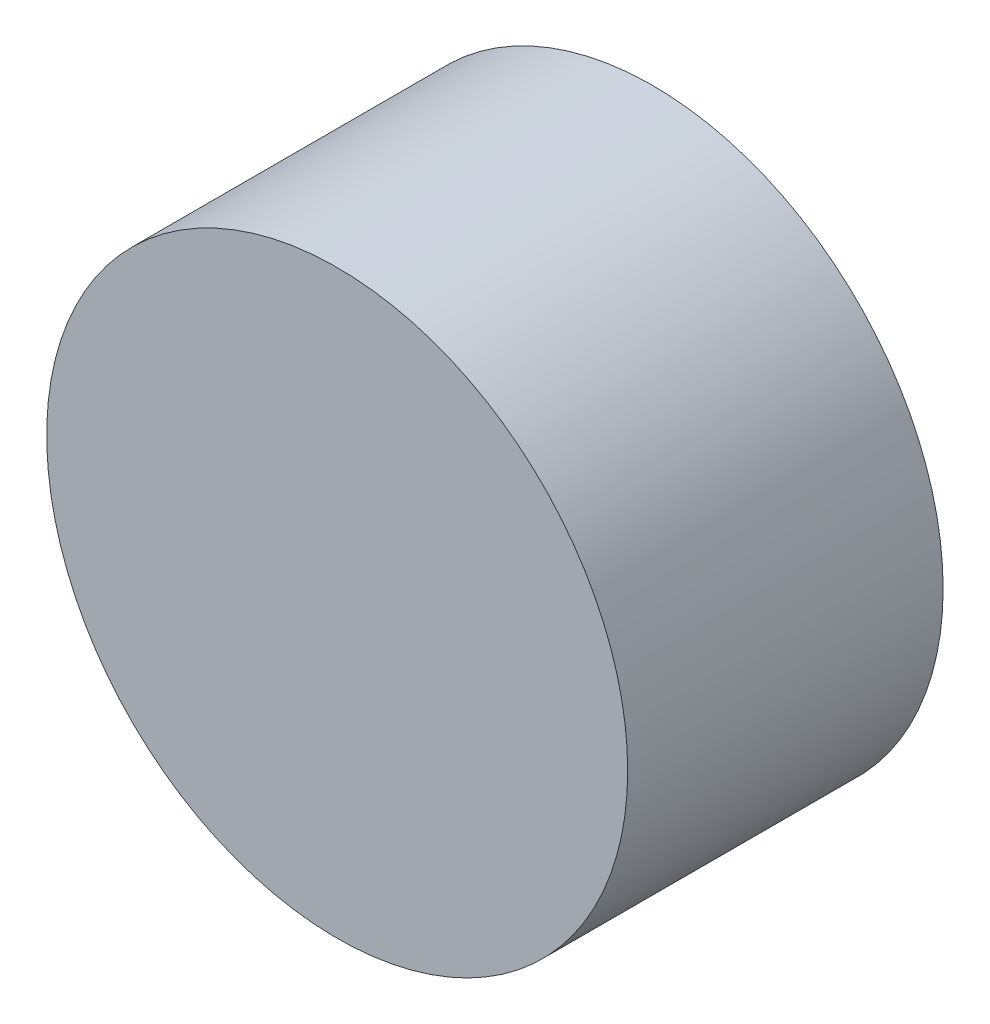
ISO-10303-21;
HEADER;
FILE_DESCRIPTION(('STEP AP214'),'2;1');
FILE_NAME('part.step','',(''),(''),'','','');
FILE_SCHEMA(('AUTOMOTIVE_DESIGN { 1 0 10303 214 1 1 1 1 }'));
ENDSEC;
DATA;
#1=APPLICATION_CONTEXT('core data for automotive mechanical design processes');
#2=APPLICATION_PROTOCOL_DEFINITION('international standard','automotive_design',2000,#1);
#3=PRODUCT_CONTEXT('',#1,'mechanical');
#4=PRODUCT('Part','Part','',(#3));
#5=PRODUCT_RELATED_PRODUCT_CATEGORY('part','',(#4));
#6=PRODUCT_DEFINITION_FORMATION('','',#4);
#7=PRODUCT_DEFINITION_CONTEXT('part definition',#1,'design');
#8=PRODUCT_DEFINITION('design','',#6,#7);
#9=PRODUCT_DEFINITION_SHAPE('','',#8);
#10=(LENGTH_UNIT() NAMED_UNIT(*) SI_UNIT(.MILLI.,.METRE.));
#11=(NAMED_UNIT(*) PLANE_ANGLE_UNIT() SI_UNIT($,.RADIAN.));
#12=(NAMED_UNIT(*) SI_UNIT($,.STERADIAN.) SOLID_ANGLE_UNIT());
#13=UNCERTAINTY_MEASURE_WITH_UNIT(LENGTH_MEASURE(1.E-05),#10,'distance_accuracy_value','');
#14=(GEOMETRIC_REPRESENTATION_CONTEXT(3) GLOBAL_UNCERTAINTY_ASSIGNED_CONTEXT((#13)) GLOBAL_UNIT_ASSIGNED_CONTEXT((#10,
#11,#12)) REPRESENTATION_CONTEXT('',''));
#15=CARTESIAN_POINT('',(0.,0.,0.));
#16=DIRECTION('',(0.,0.,1.));
#17=DIRECTION('',(1.,0.,0.));
#18=AXIS2_PLACEMENT_3D('',#15,#16,#17);
#19=CARTESIAN_POINT('',(0.,0.,17.5));
#20=DIRECTION('',(0.,0.,-1.));
#21=DIRECTION('',(-1.,0.,0.));
#22=AXIS2_PLACEMENT_3D('',#19,#20,#21);
#23=CYLINDRICAL_SURFACE('',#22,17.5);
#24=CARTESIAN_POINT('',(0.,0.,17.5));
#25=DIRECTION('',(0.,0.,1.));
#26=DIRECTION('',(1.,0.,0.));
#27=AXIS2_PLACEMENT_3D('',#24,#25,#26);
#28=CIRCLE('',#27,17.5);
#29=CARTESIAN_POINT('',(17.5,0.,17.5));
#30=VERTEX_POINT('',#29);
#31=EDGE_CURVE('E11',#30,#30,#28,.T.);
#32=ORIENTED_EDGE('',*,*,#31,.F.);
#33=EDGE_LOOP('',(#32));
#34=FACE_BOUND('',#33,.T.);
#35=CARTESIAN_POINT('',(0.,0.,-1.5));
#36=DIRECTION('',(0.,0.,1.));
#37=DIRECTION('',(1.,0.,0.));
#38=AXIS2_PLACEMENT_3D('',#35,#36,#37);
#39=CIRCLE('',#38,17.5);
#40=CARTESIAN_POINT('',(17.5,0.,-1.5));
#41=VERTEX_POINT('',#40);
#42=EDGE_CURVE('E58',#41,#41,#39,.T.);
#43=ORIENTED_EDGE('',*,*,#42,.T.);
#44=EDGE_LOOP('',(#43));
#45=FACE_BOUND('',#44,.T.);
#46=ADVANCED_FACE('F55',(#34,#45),#23,.T.);
#47=CARTESIAN_POINT('',(0.,0.,17.5));
#48=DIRECTION('',(0.,0.,1.));
#49=DIRECTION('',(1.,0.,0.));
#50=AXIS2_PLACEMENT_3D('',#47,#48,#49);
#51=PLANE('',#50);
#52=ORIENTED_EDGE('',*,*,#31,.T.);
#53=EDGE_LOOP('',(#52));
#54=FACE_BOUND('',#53,.T.);
#55=ADVANCED_FACE('F70',(#54),#51,.T.);
#56=CARTESIAN_POINT('',(0.,0.,-1.5));
#57=DIRECTION('',(0.,0.,1.));
#58=DIRECTION('',(1.,0.,0.));
#59=AXIS2_PLACEMENT_3D('',#56,#57,#58);
#60=PLANE('',#59);
#61=ORIENTED_EDGE('',*,*,#42,.F.);
#62=EDGE_LOOP('',(#61));
#63=FACE_BOUND('',#62,.T.);
#64=ADVANCED_FACE('F68',(#63),#60,.F.);
#65=CLOSED_SHELL('',(#46,#55,#64));
#66=MANIFOLD_SOLID_BREP('B2_NOT_SHOWN',#65);
#67=CARTESIAN_POINT('',(0.,0.,0.));
#68=DIRECTION('',(0.,0.,1.));
#69=DIRECTION('',(1.,0.,0.));
#70=AXIS2_PLACEMENT_3D('',#67,#68,#69);
#71=PLANE('',#70);
#72=CARTESIAN_POINT('',(0.,0.,0.));
#73=DIRECTION('',(0.,0.,1.));
#74=DIRECTION('',(1.,0.,0.));
#75=AXIS2_PLACEMENT_3D('',#72,#73,#74);
#76=CIRCLE('',#75,3.);
#77=CARTESIAN_POINT('',(3.,0.,0.));
#78=VERTEX_POINT('',#77);
#79=EDGE_CURVE('E53',#78,#78,#76,.F.);
#80=ORIENTED_EDGE('',*,*,#79,.T.);
#81=EDGE_LOOP('',(#80));
#82=FACE_BOUND('',#81,.T.);
#83=CARTESIAN_POINT('',(0.,0.,0.));
#84=DIRECTION('',(0.,0.,1.));
#85=DIRECTION('',(1.,0.,0.));
#86=AXIS2_PLACEMENT_3D('',#83,#84,#85);
#87=CIRCLE('',#86,17.);
#88=CARTESIAN_POINT('',(-15.2783396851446,-7.45468553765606,0.));
#89=VERTEX_POINT('',#88);
#90=CARTESIAN_POINT('',(-1.18322278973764,-16.9587730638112,0.));
#91=VERTEX_POINT('',#90);
#92=EDGE_CURVE('E800',#89,#91,#87,.T.);
#93=ORIENTED_EDGE('',*,*,#92,.T.);
#94=CARTESIAN_POINT('',(14.0951168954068,-9.50408752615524,0.));
#95=VERTEX_POINT('',#94);
#96=EDGE_CURVE('E627',#91,#95,#87,.T.);
#97=ORIENTED_EDGE('',*,*,#96,.T.);
#98=CARTESIAN_POINT('',(15.2783396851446,7.45468553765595,0.));
#99=VERTEX_POINT('',#98);
#100=EDGE_CURVE('E633',#95,#99,#87,.T.);
#101=ORIENTED_EDGE('',*,*,#100,.T.);
#102=CARTESIAN_POINT('',(1.18322278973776,16.9587730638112,0.));
#103=VERTEX_POINT('',#102);
#104=EDGE_CURVE('E637',#99,#103,#87,.T.);
#105=ORIENTED_EDGE('',*,*,#104,.T.);
#106=CARTESIAN_POINT('',(-14.0951168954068,9.50408752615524,0.));
#107=VERTEX_POINT('',#106);
#108=EDGE_CURVE('E794',#103,#107,#87,.T.);
#109=ORIENTED_EDGE('',*,*,#108,.T.);
#110=EDGE_CURVE('E797',#107,#89,#87,.T.);
#111=ORIENTED_EDGE('',*,*,#110,.T.);
#112=EDGE_LOOP('',(#93,#97,#101,#105,#109,#111));
#113=FACE_BOUND('',#112,.T.);
#114=CARTESIAN_POINT('',(-1.20493993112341,-15.5447781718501,0.));
#115=DIRECTION('',(0.,0.,1.));
#116=DIRECTION('',(1.,0.,0.));
#117=AXIS2_PLACEMENT_3D('',#114,#115,#116);
#118=CIRCLE('',#117,1.);
#119=CARTESIAN_POINT('',(-0.487012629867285,-16.2408962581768,0.));
#120=VERTEX_POINT('',#119);
#121=CARTESIAN_POINT('',(-1.90107800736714,-16.2626860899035,0.));
#122=VERTEX_POINT('',#121);
#123=EDGE_CURVE('E781',#120,#122,#118,.F.);
#124=ORIENTED_EDGE('',*,*,#123,.T.);
#125=DIRECTION('',(0.717907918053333,-0.696138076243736,0.));
#126=VECTOR('',#125,1.);
#127=CARTESIAN_POINT('',(-1.90113070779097,-16.2626349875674,0.));
#128=LINE('',#127,#126);
#129=CARTESIAN_POINT('',(-1.90113070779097,-16.2626349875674,0.));
#130=VERTEX_POINT('',#129);
#131=EDGE_CURVE('E118',#130,#122,#128,.T.);
#132=ORIENTED_EDGE('',*,*,#131,.F.);
#133=CARTESIAN_POINT('',(7.89663166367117,-1.28187689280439,0.));
#134=CARTESIAN_POINT('',(5.28215535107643,-8.94366934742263,0.));
#135=CARTESIAN_POINT('',(4.66881068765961,-9.48723638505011,0.));
#136=CARTESIAN_POINT('',(-1.90113070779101,-16.2626349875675,0.));
#137=B_SPLINE_CURVE_WITH_KNOTS('',3,(#133,#134,#135,#136),.UNSPECIFIED.,.F.,.F.,(4,4),(0.,
0.864171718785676),.UNSPECIFIED.);
#138=CARTESIAN_POINT('',(7.89663166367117,-1.28187689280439,0.));
#139=VERTEX_POINT('',#138);
#140=EDGE_CURVE('E338',#139,#130,#137,.T.);
#141=ORIENTED_EDGE('',*,*,#140,.F.);
#142=CARTESIAN_POINT('',(7.57134243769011,-2.22749146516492,0.));
#143=DIRECTION('',(0.,0.,1.));
#144=DIRECTION('',(1.,0.,0.));
#145=AXIS2_PLACEMENT_3D('',#142,#143,#144);
#146=CIRCLE('',#145,1.);
#147=CARTESIAN_POINT('',(8.51599891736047,-2.55555264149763,0.));
#148=VERTEX_POINT('',#147);
#149=EDGE_CURVE('E712',#139,#148,#146,.F.);
#150=ORIENTED_EDGE('',*,*,#149,.T.);
#151=CARTESIAN_POINT('',(-1.18322278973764,-16.9587730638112,0.));
#152=CARTESIAN_POINT('',(-0.983675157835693,-16.7529851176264,0.));
#153=CARTESIAN_POINT('',(-0.576486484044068,-16.3332364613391,0.));
#154=CARTESIAN_POINT('',(0.173557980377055,-15.5595231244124,0.));
#155=CARTESIAN_POINT('',(1.03985632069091,-14.6624553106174,0.));
#156=CARTESIAN_POINT('',(1.96368542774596,-13.6922486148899,0.));
#157=CARTESIAN_POINT('',(3.06288306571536,-12.5074881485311,0.));
#158=CARTESIAN_POINT('',(4.21725671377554,-11.1808158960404,0.));
#159=CARTESIAN_POINT('',(5.34267619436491,-9.67164693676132,0.));
#160=CARTESIAN_POINT('',(6.28150120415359,-8.10238629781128,0.));
#161=CARTESIAN_POINT('',(6.9710506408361,-6.64147638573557,0.));
#162=CARTESIAN_POINT('',(7.51411744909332,-5.31089092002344,0.));
#163=CARTESIAN_POINT('',(7.92941839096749,-4.21316048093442,0.));
#164=CARTESIAN_POINT('',(8.29380700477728,-3.19468941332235,0.));
#165=CARTESIAN_POINT('',(8.59971301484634,-2.31546747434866,0.));
#166=CARTESIAN_POINT('',(8.76322302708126,-1.83875519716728,0.));
#167=CARTESIAN_POINT('',(8.84304743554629,-1.60482764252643,0.));
#168=B_SPLINE_CURVE_WITH_KNOTS('',3,(#151,#152,#153,#154,#155,#156,#157,#158,#159,#160,#161,
#162,#163,#164,#165,#166,#167),.UNSPECIFIED.,.F.,.F.,(4,1,1,1,1,1,1,1,1,1,1,1,1,1,4),(0.,
0.0270053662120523,0.0540107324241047,0.10802146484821,0.162032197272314,0.216042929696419,
0.324064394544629,0.432085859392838,0.540107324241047,0.648128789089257,0.702139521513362,
0.756150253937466,0.810160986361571,0.837166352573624,0.864171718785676),.UNSPECIFIED.);
#169=EDGE_CURVE('E334',#120,#148,#168,.T.);
#170=ORIENTED_EDGE('',*,*,#169,.F.);
#171=EDGE_LOOP('',(#124,#132,#141,#150,#170));
#172=FACE_BOUND('',#171,.T.);
#173=CARTESIAN_POINT('',(-14.0646427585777,-6.72888049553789,0.));
#174=DIRECTION('',(0.,0.,1.));
#175=DIRECTION('',(1.,0.,0.));
#176=AXIS2_PLACEMENT_3D('',#173,#174,#175);
#177=CIRCLE('',#176,1.);
#178=CARTESIAN_POINT('',(-14.3085350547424,-7.69868281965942,0.));
#179=VERTEX_POINT('',#178);
#180=CARTESIAN_POINT('',(-15.0344382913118,-6.48496119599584,0.));
#181=VERTEX_POINT('',#180);
#182=EDGE_CURVE('E768',#179,#181,#177,.F.);
#183=ORIENTED_EDGE('',*,*,#182,.T.);
#184=DIRECTION('',(-0.24391929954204,-0.96979553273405,0.));
#185=VECTOR('',#184,1.);
#186=CARTESIAN_POINT('',(-15.0344203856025,-6.48489000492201,0.));
#187=LINE('',#186,#185);
#188=CARTESIAN_POINT('',(-15.0344203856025,-6.48489000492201,0.));
#189=VERTEX_POINT('',#188);
#190=EDGE_CURVE('E346',#189,#181,#187,.T.);
#191=ORIENTED_EDGE('',*,*,#190,.F.);
#192=CARTESIAN_POINT('',(2.8381778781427,-7.47962207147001,0.));
#193=CARTESIAN_POINT('',(-5.104367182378,-9.0463153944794,0.));
#194=CARTESIAN_POINT('',(-5.88178237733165,-8.78692685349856,0.));
#195=CARTESIAN_POINT('',(-15.0344203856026,-6.48489000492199,0.));
#196=B_SPLINE_CURVE_WITH_KNOTS('',3,(#192,#193,#194,#195),.UNSPECIFIED.,.F.,.F.,(4,4),(0.,
0.864171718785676),.UNSPECIFIED.);
#197=CARTESIAN_POINT('',(2.8381778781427,-7.47962207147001,0.));
#198=VERTEX_POINT('',#197);
#199=EDGE_CURVE('E340',#198,#189,#196,.T.);
#200=ORIENTED_EDGE('',*,*,#199,.F.);
#201=CARTESIAN_POINT('',(1.85660702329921,-7.6707206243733,0.));
#202=DIRECTION('',(0.,0.,1.));
#203=DIRECTION('',(1.,0.,0.));
#204=AXIS2_PLACEMENT_3D('',#201,#202,#203);
#205=CIRCLE('',#204,1.);
#206=CARTESIAN_POINT('',(2.04482595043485,-8.65284772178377,0.));
#207=VERTEX_POINT('',#206);
#208=EDGE_CURVE('E702',#198,#207,#205,.F.);
#209=ORIENTED_EDGE('',*,*,#208,.T.);
#210=CARTESIAN_POINT('',(-15.2783396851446,-7.45468553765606,0.));
#211=CARTESIAN_POINT('',(-15.000348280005,-7.52460488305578,0.));
#212=CARTESIAN_POINT('',(-14.43324094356,-7.66736629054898,0.));
#213=CARTESIAN_POINT('',(-13.3881633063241,-7.93006718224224,0.));
#214=CARTESIAN_POINT('',(-12.1781306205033,-8.23176964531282,0.));
#215=CARTESIAN_POINT('',(-10.875992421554,-8.54672577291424,0.));
#216=CARTESIAN_POINT('',(-9.30036094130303,-8.90627861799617,0.));
#217=CARTESIAN_POINT('',(-7.57424224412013,-9.24265939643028,0.));
#218=CARTESIAN_POINT('',(-5.70455384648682,-9.46271677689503,0.));
#219=CARTESIAN_POINT('',(-3.87612176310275,-9.49113276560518,0.));
#220=CARTESIAN_POINT('',(-2.26616194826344,-9.35784513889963,0.));
#221=CARTESIAN_POINT('',(-0.842307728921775,-9.16286205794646,0.));
#222=CARTESIAN_POINT('',(0.316005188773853,-8.97365800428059,0.));
#223=CARTESIAN_POINT('',(1.38022131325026,-8.77999226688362,0.));
#224=CARTESIAN_POINT('',(2.29460285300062,-8.60530367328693,0.));
#225=CARTESIAN_POINT('',(2.78920280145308,-8.50855135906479,0.));
#226=CARTESIAN_POINT('',(3.03170221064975,-8.46071754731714,0.));
#227=B_SPLINE_CURVE_WITH_KNOTS('',3,(#210,#211,#212,#213,#214,#215,#216,#217,#218,#219,#220,
#221,#222,#223,#224,#225,#226),.UNSPECIFIED.,.F.,.F.,(4,1,1,1,1,1,1,1,1,1,1,1,1,1,4),(0.,
0.0270053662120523,0.0540107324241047,0.10802146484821,0.162032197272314,0.216042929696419,
0.324064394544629,0.432085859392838,0.540107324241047,0.648128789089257,0.702139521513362,
0.756150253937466,0.810160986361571,0.837166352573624,0.864171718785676),.UNSPECIFIED.);
#228=EDGE_CURVE('E359',#179,#207,#227,.T.);
#229=ORIENTED_EDGE('',*,*,#228,.F.);
#230=EDGE_LOOP('',(#183,#191,#200,#209,#229));
#231=FACE_BOUND('',#230,.T.);
#232=CARTESIAN_POINT('',(-12.8597028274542,8.81589767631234,0.));
#233=DIRECTION('',(0.,0.,1.));
#234=DIRECTION('',(1.,0.,0.));
#235=AXIS2_PLACEMENT_3D('',#232,#233,#234);
#236=CIRCLE('',#235,1.);
#237=CARTESIAN_POINT('',(-13.821522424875,8.54221343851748,0.));
#238=VERTEX_POINT('',#237);
#239=CARTESIAN_POINT('',(-13.1333602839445,9.77772489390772,0.));
#240=VERTEX_POINT('',#239);
#241=EDGE_CURVE('E754',#238,#240,#236,.F.);
#242=ORIENTED_EDGE('',*,*,#241,.T.);
#243=DIRECTION('',(-0.961827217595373,-0.273657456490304,0.));
#244=VECTOR('',#243,1.);
#245=CARTESIAN_POINT('',(-13.1332896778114,9.77774498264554,0.));
#246=LINE('',#245,#244);
#247=CARTESIAN_POINT('',(-13.1332896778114,9.77774498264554,0.));
#248=VERTEX_POINT('',#247);
#249=EDGE_CURVE('E402',#248,#240,#246,.T.);
#250=ORIENTED_EDGE('',*,*,#249,.F.);
#251=CARTESIAN_POINT('',(-5.05845378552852,-6.19774517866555,0.));
#252=CARTESIAN_POINT('',(-10.3865225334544,-0.102646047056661,0.));
#253=CARTESIAN_POINT('',(-10.5505930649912,0.700309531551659,0.));
#254=CARTESIAN_POINT('',(-13.1332896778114,9.7777449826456,0.));
#255=B_SPLINE_CURVE_WITH_KNOTS('',3,(#251,#252,#253,#254),.UNSPECIFIED.,.F.,.F.,(4,4),(0.,
0.864171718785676),.UNSPECIFIED.);
#256=CARTESIAN_POINT('',(-5.05845378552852,-6.19774517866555,0.));
#257=VERTEX_POINT('',#256);
#258=EDGE_CURVE('E393',#257,#248,#255,.T.);
#259=ORIENTED_EDGE('',*,*,#258,.F.);
#260=CARTESIAN_POINT('',(-5.71473541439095,-5.44322915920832,0.));
#261=DIRECTION('',(0.,0.,1.));
#262=DIRECTION('',(1.,0.,0.));
#263=AXIS2_PLACEMENT_3D('',#260,#261,#262);
#264=CIRCLE('',#263,1.);
#265=CARTESIAN_POINT('',(-6.47117296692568,-6.09729508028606,0.));
#266=VERTEX_POINT('',#265);
#267=EDGE_CURVE('E691',#257,#266,#264,.F.);
#268=ORIENTED_EDGE('',*,*,#267,.T.);
#269=CARTESIAN_POINT('',(-14.0951168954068,9.50408752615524,0.));
#270=CARTESIAN_POINT('',(-14.0166731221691,9.22838023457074,0.));
#271=CARTESIAN_POINT('',(-13.8567544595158,8.66587017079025,0.));
#272=CARTESIAN_POINT('',(-13.561721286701,7.62945594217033,0.));
#273=CARTESIAN_POINT('',(-13.2179869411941,6.43068566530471,0.));
#274=CARTESIAN_POINT('',(-12.8396778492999,5.1455228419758,0.));
#275=CARTESIAN_POINT('',(-12.3632440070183,3.60120953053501,0.));
#276=CARTESIAN_POINT('',(-11.7914989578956,1.93815649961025,0.));
#277=CARTESIAN_POINT('',(-11.0472300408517,0.208930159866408,0.));
#278=CARTESIAN_POINT('',(-10.1576229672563,-1.38874646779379,0.));
#279=CARTESIAN_POINT('',(-9.23721258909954,-2.71636875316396,0.));
#280=CARTESIAN_POINT('',(-8.35642517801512,-3.85197113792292,0.));
#281=CARTESIAN_POINT('',(-7.61341320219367,-4.76049752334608,0.));
#282=CARTESIAN_POINT('',(-6.91358569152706,-5.58530285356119,0.));
#283=CARTESIAN_POINT('',(-6.30511016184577,-6.28983619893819,0.));
#284=CARTESIAN_POINT('',(-5.97402022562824,-6.66979616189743,0.));
#285=CARTESIAN_POINT('',(-5.8113452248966,-6.85588990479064,0.));
#286=B_SPLINE_CURVE_WITH_KNOTS('',3,(#269,#270,#271,#272,#273,#274,#275,#276,#277,#278,#279,
#280,#281,#282,#283,#284,#285),.UNSPECIFIED.,.F.,.F.,(4,1,1,1,1,1,1,1,1,1,1,1,1,1,4),(0.,
0.0270053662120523,0.0540107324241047,0.10802146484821,0.162032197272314,0.216042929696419,
0.324064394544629,0.432085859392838,0.540107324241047,0.648128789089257,0.702139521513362,
0.756150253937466,0.810160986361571,0.837166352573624,0.864171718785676),.UNSPECIFIED.);
#287=EDGE_CURVE('E409',#238,#266,#286,.T.);
#288=ORIENTED_EDGE('',*,*,#287,.F.);
#289=EDGE_LOOP('',(#242,#250,#259,#268,#288));
#290=FACE_BOUND('',#289,.T.);
#291=CARTESIAN_POINT('',(1.20493993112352,15.5447781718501,0.));
#292=DIRECTION('',(0.,0.,1.));
#293=DIRECTION('',(1.,0.,0.));
#294=AXIS2_PLACEMENT_3D('',#291,#292,#293);
#295=CIRCLE('',#294,1.);
#296=CARTESIAN_POINT('',(0.487012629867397,16.2408962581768,0.));
#297=VERTEX_POINT('',#296);
#298=CARTESIAN_POINT('',(1.90107800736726,16.2626860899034,0.));
#299=VERTEX_POINT('',#298);
#300=EDGE_CURVE('E740',#297,#299,#295,.F.);
#301=ORIENTED_EDGE('',*,*,#300,.T.);
#302=DIRECTION('',(-0.717907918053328,0.696138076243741,0.));
#303=VECTOR('',#302,1.);
#304=CARTESIAN_POINT('',(1.90113070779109,16.2626349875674,0.));
#305=LINE('',#304,#303);
#306=CARTESIAN_POINT('',(1.90113070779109,16.2626349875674,0.));
#307=VERTEX_POINT('',#306);
#308=EDGE_CURVE('E1375',#307,#299,#305,.T.);
#309=ORIENTED_EDGE('',*,*,#308,.F.);
#310=CARTESIAN_POINT('',(-7.89663166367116,1.28187689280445,0.));
#311=CARTESIAN_POINT('',(-5.28215535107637,8.94366934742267,0.));
#312=CARTESIAN_POINT('',(-4.66881068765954,9.48723638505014,0.));
#313=CARTESIAN_POINT('',(1.90113070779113,16.2626349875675,0.));
#314=B_SPLINE_CURVE_WITH_KNOTS('',3,(#310,#311,#312,#313),.UNSPECIFIED.,.F.,.F.,(4,4),(0.,
0.864171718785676),.UNSPECIFIED.);
#315=CARTESIAN_POINT('',(-7.89663166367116,1.28187689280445,0.));
#316=VERTEX_POINT('',#315);
#317=EDGE_CURVE('E424',#316,#307,#314,.T.);
#318=ORIENTED_EDGE('',*,*,#317,.F.);
#319=CARTESIAN_POINT('',(-7.5713424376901,2.22749146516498,0.));
#320=DIRECTION('',(0.,0.,1.));
#321=DIRECTION('',(1.,0.,0.));
#322=AXIS2_PLACEMENT_3D('',#319,#320,#321);
#323=CIRCLE('',#322,1.);
#324=CARTESIAN_POINT('',(-8.51599891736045,2.55555264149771,0.));
#325=VERTEX_POINT('',#324);
#326=EDGE_CURVE('E680',#316,#325,#323,.F.);
#327=ORIENTED_EDGE('',*,*,#326,.T.);
#328=CARTESIAN_POINT('',(1.18322278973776,16.9587730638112,0.));
#329=CARTESIAN_POINT('',(0.983675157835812,16.7529851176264,0.));
#330=CARTESIAN_POINT('',(0.576486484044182,16.3332364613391,0.));
#331=CARTESIAN_POINT('',(-0.173557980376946,15.5595231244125,0.));
#332=CARTESIAN_POINT('',(-1.03985632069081,14.6624553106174,0.));
#333=CARTESIAN_POINT('',(-1.96368542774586,13.6922486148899,0.));
#334=CARTESIAN_POINT('',(-3.06288306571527,12.5074881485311,0.));
#335=CARTESIAN_POINT('',(-4.21725671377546,11.1808158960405,0.));
#336=CARTESIAN_POINT('',(-5.34267619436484,9.67164693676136,0.));
#337=CARTESIAN_POINT('',(-6.28150120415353,8.10238629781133,0.));
#338=CARTESIAN_POINT('',(-6.97105064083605,6.64147638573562,0.));
#339=CARTESIAN_POINT('',(-7.51411744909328,5.3108909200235,0.));
#340=CARTESIAN_POINT('',(-7.92941839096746,4.21316048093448,0.));
#341=CARTESIAN_POINT('',(-8.29380700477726,3.19468941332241,0.));
#342=CARTESIAN_POINT('',(-8.59971301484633,2.31546747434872,0.));
#343=CARTESIAN_POINT('',(-8.76322302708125,1.83875519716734,0.));
#344=CARTESIAN_POINT('',(-8.84304743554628,1.60482764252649,0.));
#345=B_SPLINE_CURVE_WITH_KNOTS('',3,(#328,#329,#330,#331,#332,#333,#334,#335,#336,#337,#338,
#339,#340,#341,#342,#343,#344),.UNSPECIFIED.,.F.,.F.,(4,1,1,1,1,1,1,1,1,1,1,1,1,1,4),(0.,
0.0270053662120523,0.0540107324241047,0.10802146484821,0.162032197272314,0.216042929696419,
0.324064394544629,0.432085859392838,0.540107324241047,0.648128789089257,0.702139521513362,
0.756150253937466,0.810160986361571,0.837166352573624,0.864171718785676),.UNSPECIFIED.);
#346=EDGE_CURVE('E433',#297,#325,#345,.T.);
#347=ORIENTED_EDGE('',*,*,#346,.F.);
#348=EDGE_LOOP('',(#301,#309,#318,#327,#347));
#349=FACE_BOUND('',#348,.T.);
#350=DIRECTION('',(0.961827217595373,0.273657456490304,0.));
#351=VECTOR('',#350,1.);
#352=CARTESIAN_POINT('',(13.1332896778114,-9.77774498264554,0.));
#353=LINE('',#352,#351);
#354=CARTESIAN_POINT('',(13.1332896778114,-9.77774498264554,0.));
#355=VERTEX_POINT('',#354);
#356=CARTESIAN_POINT('',(13.1333602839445,-9.77772489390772,0.));
#357=VERTEX_POINT('',#356);
#358=EDGE_CURVE('E824',#355,#357,#353,.T.);
#359=ORIENTED_EDGE('',*,*,#358,.F.);
#360=CARTESIAN_POINT('',(5.05845378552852,6.19774517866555,0.));
#361=CARTESIAN_POINT('',(10.3865225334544,0.102646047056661,0.));
#362=CARTESIAN_POINT('',(10.5505930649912,-0.700309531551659,0.));
#363=CARTESIAN_POINT('',(13.1332896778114,-9.7777449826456,0.));
#364=B_SPLINE_CURVE_WITH_KNOTS('',3,(#360,#361,#362,#363),.UNSPECIFIED.,.F.,.F.,(4,4),(0.,
0.864171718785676),.UNSPECIFIED.);
#365=CARTESIAN_POINT('',(5.05845378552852,6.19774517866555,0.));
#366=VERTEX_POINT('',#365);
#367=EDGE_CURVE('E498',#366,#355,#364,.T.);
#368=ORIENTED_EDGE('',*,*,#367,.F.);
#369=CARTESIAN_POINT('',(5.71473541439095,5.44322915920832,0.));
#370=DIRECTION('',(0.,0.,1.));
#371=DIRECTION('',(1.,0.,0.));
#372=AXIS2_PLACEMENT_3D('',#369,#370,#371);
#373=CIRCLE('',#372,1.);
#374=CARTESIAN_POINT('',(6.47117296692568,6.09729508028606,0.));
#375=VERTEX_POINT('',#374);
#376=EDGE_CURVE('E644',#366,#375,#373,.F.);
#377=ORIENTED_EDGE('',*,*,#376,.T.);
#378=CARTESIAN_POINT('',(14.0951168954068,-9.50408752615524,0.));
#379=CARTESIAN_POINT('',(14.0166731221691,-9.22838023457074,0.));
#380=CARTESIAN_POINT('',(13.8567544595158,-8.66587017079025,0.));
#381=CARTESIAN_POINT('',(13.561721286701,-7.62945594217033,0.));
#382=CARTESIAN_POINT('',(13.2179869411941,-6.43068566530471,0.));
#383=CARTESIAN_POINT('',(12.8396778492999,-5.1455228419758,0.));
#384=CARTESIAN_POINT('',(12.3632440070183,-3.60120953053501,0.));
#385=CARTESIAN_POINT('',(11.7914989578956,-1.93815649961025,0.));
#386=CARTESIAN_POINT('',(11.0472300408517,-0.208930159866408,0.));
#387=CARTESIAN_POINT('',(10.1576229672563,1.38874646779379,0.));
#388=CARTESIAN_POINT('',(9.23721258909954,2.71636875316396,0.));
#389=CARTESIAN_POINT('',(8.35642517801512,3.85197113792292,0.));
#390=CARTESIAN_POINT('',(7.61341320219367,4.76049752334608,0.));
#391=CARTESIAN_POINT('',(6.91358569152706,5.58530285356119,0.));
#392=CARTESIAN_POINT('',(6.30511016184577,6.28983619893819,0.));
#393=CARTESIAN_POINT('',(5.97402022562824,6.66979616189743,0.));
#394=CARTESIAN_POINT('',(5.8113452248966,6.85588990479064,0.));
#395=B_SPLINE_CURVE_WITH_KNOTS('',3,(#378,#379,#380,#381,#382,#383,#384,#385,#386,#387,#388,
#389,#390,#391,#392,#393,#394),.UNSPECIFIED.,.F.,.F.,(4,1,1,1,1,1,1,1,1,1,1,1,1,1,4),(0.,
0.0270053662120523,0.0540107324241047,0.10802146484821,0.162032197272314,0.216042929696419,
0.324064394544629,0.432085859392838,0.540107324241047,0.648128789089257,0.702139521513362,
0.756150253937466,0.810160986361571,0.837166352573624,0.864171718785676),.UNSPECIFIED.);
#396=CARTESIAN_POINT('',(13.821522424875,-8.54221343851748,0.));
#397=VERTEX_POINT('',#396);
#398=EDGE_CURVE('E507',#397,#375,#395,.T.);
#399=ORIENTED_EDGE('',*,*,#398,.F.);
#400=CARTESIAN_POINT('',(12.8597028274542,-8.81589767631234,0.));
#401=DIRECTION('',(0.,0.,1.));
#402=DIRECTION('',(1.,0.,0.));
#403=AXIS2_PLACEMENT_3D('',#400,#401,#402);
#404=CIRCLE('',#403,1.);
#405=EDGE_CURVE('E658',#397,#357,#404,.F.);
#406=ORIENTED_EDGE('',*,*,#405,.T.);
#407=EDGE_LOOP('',(#359,#368,#377,#399,#406));
#408=FACE_BOUND('',#407,.T.);
#409=CARTESIAN_POINT('',(14.0646427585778,6.72888049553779,0.));
#410=DIRECTION('',(0.,0.,1.));
#411=DIRECTION('',(1.,0.,0.));
#412=AXIS2_PLACEMENT_3D('',#409,#410,#411);
#413=CIRCLE('',#412,1.);
#414=CARTESIAN_POINT('',(14.3085350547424,7.69868281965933,0.));
#415=VERTEX_POINT('',#414);
#416=CARTESIAN_POINT('',(15.0344382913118,6.48496119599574,0.));
#417=VERTEX_POINT('',#416);
#418=EDGE_CURVE('E726',#415,#417,#413,.F.);
#419=ORIENTED_EDGE('',*,*,#418,.T.);
#420=DIRECTION('',(0.243919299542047,0.969795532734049,0.));
#421=VECTOR('',#420,1.);
#422=CARTESIAN_POINT('',(15.0344203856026,6.4848900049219,0.));
#423=LINE('',#422,#421);
#424=CARTESIAN_POINT('',(15.0344203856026,6.4848900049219,0.));
#425=VERTEX_POINT('',#424);
#426=EDGE_CURVE('E476',#425,#417,#423,.T.);
#427=ORIENTED_EDGE('',*,*,#426,.F.);
#428=CARTESIAN_POINT('',(-2.83817787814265,7.47962207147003,0.));
#429=CARTESIAN_POINT('',(5.10436718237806,9.04631539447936,0.));
#430=CARTESIAN_POINT('',(5.88178237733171,8.78692685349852,0.));
#431=CARTESIAN_POINT('',(15.0344203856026,6.48489000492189,0.));
#432=B_SPLINE_CURVE_WITH_KNOTS('',3,(#428,#429,#430,#431),.UNSPECIFIED.,.F.,.F.,(4,4),(0.,
0.864171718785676),.UNSPECIFIED.);
#433=CARTESIAN_POINT('',(-2.83817787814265,7.47962207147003,0.));
#434=VERTEX_POINT('',#433);
#435=EDGE_CURVE('E467',#434,#425,#432,.T.);
#436=ORIENTED_EDGE('',*,*,#435,.F.);
#437=CARTESIAN_POINT('',(-1.85660702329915,7.67072062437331,0.));
#438=DIRECTION('',(0.,0.,1.));
#439=DIRECTION('',(1.,0.,0.));
#440=AXIS2_PLACEMENT_3D('',#437,#438,#439);
#441=CIRCLE('',#440,1.);
#442=CARTESIAN_POINT('',(-2.04482595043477,8.65284772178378,0.));
#443=VERTEX_POINT('',#442);
#444=EDGE_CURVE('E669',#434,#443,#441,.F.);
#445=ORIENTED_EDGE('',*,*,#444,.T.);
#446=CARTESIAN_POINT('',(15.2783396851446,7.45468553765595,0.));
#447=CARTESIAN_POINT('',(15.000348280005,7.52460488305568,0.));
#448=CARTESIAN_POINT('',(14.43324094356,7.66736629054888,0.));
#449=CARTESIAN_POINT('',(13.3881633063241,7.93006718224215,0.));
#450=CARTESIAN_POINT('',(12.1781306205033,8.23176964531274,0.));
#451=CARTESIAN_POINT('',(10.8759924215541,8.54672577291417,0.));
#452=CARTESIAN_POINT('',(9.30036094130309,8.90627861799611,0.));
#453=CARTESIAN_POINT('',(7.5742422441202,9.24265939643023,0.));
#454=CARTESIAN_POINT('',(5.70455384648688,9.46271677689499,0.));
#455=CARTESIAN_POINT('',(3.87612176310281,9.49113276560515,0.));
#456=CARTESIAN_POINT('',(2.2661619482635,9.35784513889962,0.));
#457=CARTESIAN_POINT('',(0.84230772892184,9.16286205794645,0.));
#458=CARTESIAN_POINT('',(-0.316005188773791,8.97365800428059,0.));
#459=CARTESIAN_POINT('',(-1.3802213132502,8.77999226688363,0.));
#460=CARTESIAN_POINT('',(-2.29460285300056,8.60530367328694,0.));
#461=CARTESIAN_POINT('',(-2.78920280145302,8.50855135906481,0.));
#462=CARTESIAN_POINT('',(-3.03170221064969,8.46071754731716,0.));
#463=B_SPLINE_CURVE_WITH_KNOTS('',3,(#446,#447,#448,#449,#450,#451,#452,#453,#454,#455,#456,
#457,#458,#459,#460,#461,#462),.UNSPECIFIED.,.F.,.F.,(4,1,1,1,1,1,1,1,1,1,1,1,1,1,4),(0.,
0.0270053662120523,0.0540107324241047,0.10802146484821,0.162032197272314,0.216042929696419,
0.324064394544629,0.432085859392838,0.540107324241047,0.648128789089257,0.702139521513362,
0.756150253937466,0.810160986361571,0.837166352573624,0.864171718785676),.UNSPECIFIED.);
#464=EDGE_CURVE('E483',#415,#443,#463,.T.);
#465=ORIENTED_EDGE('',*,*,#464,.F.);
#466=EDGE_LOOP('',(#419,#427,#436,#445,#465));
#467=FACE_BOUND('',#466,.T.);
#468=ADVANCED_FACE('F102',(#82,#113,#172,#231,#290,#349,#408,#467),#71,.T.);
#469=CARTESIAN_POINT('',(0.,0.,-1.));
#470=DIRECTION('',(0.,0.,1.));
#471=DIRECTION('',(1.,0.,0.));
#472=AXIS2_PLACEMENT_3D('',#469,#470,#471);
#473=CYLINDRICAL_SURFACE('',#472,17.);
#474=CARTESIAN_POINT('',(0.,0.,-1.));
#475=DIRECTION('',(0.,0.,1.));
#476=DIRECTION('',(1.,0.,0.));
#477=AXIS2_PLACEMENT_3D('',#474,#475,#476);
#478=CIRCLE('',#477,17.);
#479=CARTESIAN_POINT('',(17.,0.,-1.));
#480=VERTEX_POINT('',#479);
#481=EDGE_CURVE('E628',#480,#480,#478,.T.);
#482=ORIENTED_EDGE('',*,*,#481,.T.);
#483=EDGE_LOOP('',(#482));
#484=FACE_BOUND('',#483,.T.);
#485=ORIENTED_EDGE('',*,*,#100,.F.);
#486=ORIENTED_EDGE('',*,*,#96,.F.);
#487=ORIENTED_EDGE('',*,*,#92,.F.);
#488=ORIENTED_EDGE('',*,*,#110,.F.);
#489=ORIENTED_EDGE('',*,*,#108,.F.);
#490=ORIENTED_EDGE('',*,*,#104,.F.);
#491=EDGE_LOOP('',(#485,#486,#487,#488,#489,#490));
#492=FACE_BOUND('',#491,.T.);
#493=ADVANCED_FACE('F539',(#484,#492),#473,.T.);
#494=CARTESIAN_POINT('',(0.,0.,-1.));
#495=DIRECTION('',(0.,0.,1.));
#496=DIRECTION('',(1.,0.,0.));
#497=AXIS2_PLACEMENT_3D('',#494,#495,#496);
#498=PLANE('',#497);
#499=CARTESIAN_POINT('',(0.,0.,-1.));
#500=DIRECTION('',(0.,0.,1.));
#501=DIRECTION('',(1.,0.,0.));
#502=AXIS2_PLACEMENT_3D('',#499,#500,#501);
#503=CIRCLE('',#502,1.2);
#504=CARTESIAN_POINT('',(1.2,0.,-1.));
#505=VERTEX_POINT('',#504);
#506=EDGE_CURVE('E616',#505,#505,#503,.T.);
#507=ORIENTED_EDGE('',*,*,#506,.T.);
#508=EDGE_LOOP('',(#507));
#509=FACE_BOUND('',#508,.T.);
#510=ORIENTED_EDGE('',*,*,#481,.F.);
#511=EDGE_LOOP('',(#510));
#512=FACE_BOUND('',#511,.T.);
#513=ADVANCED_FACE('F535',(#509,#512),#498,.F.);
#514=CARTESIAN_POINT('',(0.,0.,-1.));
#515=DIRECTION('',(0.,0.,1.));
#516=DIRECTION('',(1.,0.,0.));
#517=AXIS2_PLACEMENT_3D('',#514,#515,#516);
#518=CYLINDRICAL_SURFACE('',#517,1.2);
#519=ORIENTED_EDGE('',*,*,#506,.F.);
#520=EDGE_LOOP('',(#519));
#521=FACE_BOUND('',#520,.T.);
#522=CARTESIAN_POINT('',(0.,0.,0.));
#523=DIRECTION('',(0.,0.,1.));
#524=DIRECTION('',(1.,0.,0.));
#525=AXIS2_PLACEMENT_3D('',#522,#523,#524);
#526=CIRCLE('',#525,1.2);
#527=CARTESIAN_POINT('',(1.2,0.,0.));
#528=VERTEX_POINT('',#527);
#529=EDGE_CURVE('E610',#528,#528,#526,.F.);
#530=ORIENTED_EDGE('',*,*,#529,.F.);
#531=EDGE_LOOP('',(#530));
#532=FACE_BOUND('',#531,.T.);
#533=ADVANCED_FACE('F528',(#521,#532),#518,.F.);
#534=CARTESIAN_POINT('',(0.,0.,0.));
#535=DIRECTION('',(0.,0.,1.));
#536=DIRECTION('',(1.,0.,0.));
#537=AXIS2_PLACEMENT_3D('',#534,#535,#536);
#538=PLANE('',#537);
#539=CARTESIAN_POINT('',(0.,0.,0.));
#540=DIRECTION('',(0.,0.,1.));
#541=DIRECTION('',(1.,0.,0.));
#542=AXIS2_PLACEMENT_3D('',#539,#540,#541);
#543=CIRCLE('',#542,1.);
#544=CARTESIAN_POINT('',(1.,0.,0.));
#545=VERTEX_POINT('',#544);
#546=EDGE_CURVE('E611',#545,#545,#543,.T.);
#547=ORIENTED_EDGE('',*,*,#546,.T.);
#548=EDGE_LOOP('',(#547));
#549=FACE_BOUND('',#548,.T.);
#550=ORIENTED_EDGE('',*,*,#529,.T.);
#551=EDGE_LOOP('',(#550));
#552=FACE_BOUND('',#551,.T.);
#553=ADVANCED_FACE('F525',(#549,#552),#538,.F.);
#554=CARTESIAN_POINT('',(0.,0.,6.));
#555=DIRECTION('',(0.,0.,-1.));
#556=DIRECTION('',(-1.,0.,0.));
#557=AXIS2_PLACEMENT_3D('',#554,#555,#556);
#558=CYLINDRICAL_SURFACE('',#557,2.);
#559=CARTESIAN_POINT('',(0.,0.,5.));
#560=DIRECTION('',(0.,0.,1.));
#561=DIRECTION('',(1.,0.,0.));
#562=AXIS2_PLACEMENT_3D('',#559,#560,#561);
#563=CIRCLE('',#562,2.);
#564=CARTESIAN_POINT('',(2.,0.,5.));
#565=VERTEX_POINT('',#564);
#566=EDGE_CURVE('E111',#565,#565,#563,.F.);
#567=ORIENTED_EDGE('',*,*,#566,.T.);
#568=EDGE_LOOP('',(#567));
#569=FACE_BOUND('',#568,.T.);
#570=CARTESIAN_POINT('',(0.,0.,1.));
#571=DIRECTION('',(0.,0.,1.));
#572=DIRECTION('',(1.,0.,0.));
#573=AXIS2_PLACEMENT_3D('',#570,#571,#572);
#574=CIRCLE('',#573,2.);
#575=CARTESIAN_POINT('',(2.,0.,1.));
#576=VERTEX_POINT('',#575);
#577=EDGE_CURVE('E784',#576,#576,#574,.T.);
#578=ORIENTED_EDGE('',*,*,#577,.T.);
#579=EDGE_LOOP('',(#578));
#580=FACE_BOUND('',#579,.T.);
#581=ADVANCED_FACE('F523',(#569,#580),#558,.T.);
#582=CARTESIAN_POINT('',(0.,0.,6.));
#583=DIRECTION('',(0.,0.,-1.));
#584=DIRECTION('',(-1.,0.,0.));
#585=AXIS2_PLACEMENT_3D('',#582,#583,#584);
#586=CYLINDRICAL_SURFACE('',#585,1.);
#587=CARTESIAN_POINT('',(0.,0.,6.));
#588=DIRECTION('',(0.,0.,1.));
#589=DIRECTION('',(1.,0.,0.));
#590=AXIS2_PLACEMENT_3D('',#587,#588,#589);
#591=CIRCLE('',#590,1.);
#592=CARTESIAN_POINT('',(1.,0.,6.));
#593=VERTEX_POINT('',#592);
#594=EDGE_CURVE('E608',#593,#593,#591,.T.);
#595=ORIENTED_EDGE('',*,*,#594,.T.);
#596=EDGE_LOOP('',(#595));
#597=FACE_BOUND('',#596,.T.);
#598=ORIENTED_EDGE('',*,*,#546,.F.);
#599=EDGE_LOOP('',(#598));
#600=FACE_BOUND('',#599,.T.);
#601=ADVANCED_FACE('F518',(#597,#600),#586,.F.);
#602=CARTESIAN_POINT('',(5.05845378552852,6.19774517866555,17.));
#603=CARTESIAN_POINT('',(10.3865225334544,0.102646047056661,17.));
#604=CARTESIAN_POINT('',(10.5505930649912,-0.700309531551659,17.));
#605=CARTESIAN_POINT('',(13.1332896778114,-9.7777449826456,17.));
#606=B_SPLINE_CURVE_WITH_KNOTS('',3,(#602,#603,#604,#605),.UNSPECIFIED.,.F.,.F.,(4,4),(0.,
0.864171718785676),.UNSPECIFIED.);
#607=DIRECTION('',(0.,0.,-1.));
#608=VECTOR('',#607,1.);
#609=SURFACE_OF_LINEAR_EXTRUSION('',#606,#608);
#610=ORIENTED_EDGE('',*,*,#367,.T.);
#611=DIRECTION('',(0.,0.,-1.));
#612=VECTOR('',#611,1.);
#613=CARTESIAN_POINT('',(13.1332896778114,-9.77774498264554,17.));
#614=LINE('',#613,#612);
#615=CARTESIAN_POINT('',(13.1332896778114,-9.77774498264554,17.));
#616=VERTEX_POINT('',#615);
#617=EDGE_CURVE('E619',#616,#355,#614,.T.);
#618=ORIENTED_EDGE('',*,*,#617,.F.);
#619=CARTESIAN_POINT('',(5.05845378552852,6.19774517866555,17.));
#620=VERTEX_POINT('',#619);
#621=EDGE_CURVE('E499',#620,#616,#606,.T.);
#622=ORIENTED_EDGE('',*,*,#621,.F.);
#623=DIRECTION('',(0.,0.,-1.));
#624=VECTOR('',#623,1.);
#625=CARTESIAN_POINT('',(5.05845378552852,6.19774517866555,17.));
#626=LINE('',#625,#624);
#627=EDGE_CURVE('E861',#620,#366,#626,.T.);
#628=ORIENTED_EDGE('',*,*,#627,.T.);
#629=EDGE_LOOP('',(#610,#618,#622,#628));
#630=FACE_BOUND('',#629,.T.);
#631=ADVANCED_FACE('F513',(#630),#609,.F.);
#632=CARTESIAN_POINT('',(13.1332896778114,-9.77774498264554,17.));
#633=DIRECTION('',(-0.273657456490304,0.961827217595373,0.));
#634=DIRECTION('',(-0.961827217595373,-0.273657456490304,0.));
#635=AXIS2_PLACEMENT_3D('',#632,#633,#634);
#636=PLANE('',#635);
#637=ORIENTED_EDGE('',*,*,#358,.T.);
#638=DIRECTION('',(0.,0.,-1.));
#639=VECTOR('',#638,1.);
#640=CARTESIAN_POINT('',(13.1333602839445,-9.77772489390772,17.));
#641=LINE('',#640,#639);
#642=CARTESIAN_POINT('',(13.1333602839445,-9.77772489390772,17.));
#643=VERTEX_POINT('',#642);
#644=EDGE_CURVE('E652',#357,#643,#641,.F.);
#645=ORIENTED_EDGE('',*,*,#644,.T.);
#646=DIRECTION('',(0.961827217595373,0.273657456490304,0.));
#647=VECTOR('',#646,1.);
#648=CARTESIAN_POINT('',(13.1332896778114,-9.77774498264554,17.));
#649=LINE('',#648,#647);
#650=EDGE_CURVE('E506',#616,#643,#649,.T.);
#651=ORIENTED_EDGE('',*,*,#650,.F.);
#652=ORIENTED_EDGE('',*,*,#617,.T.);
#653=EDGE_LOOP('',(#637,#645,#651,#652));
#654=FACE_BOUND('',#653,.T.);
#655=ADVANCED_FACE('F517',(#654),#636,.F.);
#656=CARTESIAN_POINT('',(14.0951168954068,-9.50408752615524,17.));
#657=CARTESIAN_POINT('',(14.0166731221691,-9.22838023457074,17.));
#658=CARTESIAN_POINT('',(13.8567544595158,-8.66587017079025,17.));
#659=CARTESIAN_POINT('',(13.561721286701,-7.62945594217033,17.));
#660=CARTESIAN_POINT('',(13.2179869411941,-6.43068566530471,17.));
#661=CARTESIAN_POINT('',(12.8396778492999,-5.1455228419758,17.));
#662=CARTESIAN_POINT('',(12.3632440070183,-3.60120953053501,17.));
#663=CARTESIAN_POINT('',(11.7914989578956,-1.93815649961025,17.));
#664=CARTESIAN_POINT('',(11.0472300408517,-0.208930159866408,17.));
#665=CARTESIAN_POINT('',(10.1576229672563,1.38874646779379,17.));
#666=CARTESIAN_POINT('',(9.23721258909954,2.71636875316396,17.));
#667=CARTESIAN_POINT('',(8.35642517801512,3.85197113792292,17.));
#668=CARTESIAN_POINT('',(7.61341320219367,4.76049752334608,17.));
#669=CARTESIAN_POINT('',(6.91358569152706,5.58530285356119,17.));
#670=CARTESIAN_POINT('',(6.30511016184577,6.28983619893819,17.));
#671=CARTESIAN_POINT('',(5.97402022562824,6.66979616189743,17.));
#672=CARTESIAN_POINT('',(5.8113452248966,6.85588990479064,17.));
#673=B_SPLINE_CURVE_WITH_KNOTS('',3,(#656,#657,#658,#659,#660,#661,#662,#663,#664,#665,#666,
#667,#668,#669,#670,#671,#672),.UNSPECIFIED.,.F.,.F.,(4,1,1,1,1,1,1,1,1,1,1,1,1,1,4),(0.,
0.0270053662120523,0.0540107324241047,0.10802146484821,0.162032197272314,0.216042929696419,
0.324064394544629,0.432085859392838,0.540107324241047,0.648128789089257,0.702139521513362,
0.756150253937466,0.810160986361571,0.837166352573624,0.864171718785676),.UNSPECIFIED.);
#674=DIRECTION('',(0.,0.,-1.));
#675=VECTOR('',#674,1.);
#676=SURFACE_OF_LINEAR_EXTRUSION('',#673,#675);
#677=CARTESIAN_POINT('',(13.821522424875,-8.54221343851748,17.));
#678=VERTEX_POINT('',#677);
#679=CARTESIAN_POINT('',(6.47117296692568,6.09729508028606,17.));
#680=VERTEX_POINT('',#679);
#681=EDGE_CURVE('E855',#678,#680,#673,.T.);
#682=ORIENTED_EDGE('',*,*,#681,.F.);
#683=DIRECTION('',(0.,0.,-1.));
#684=VECTOR('',#683,1.);
#685=CARTESIAN_POINT('',(13.821522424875,-8.54221343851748,17.));
#686=LINE('',#685,#684);
#687=EDGE_CURVE('E648',#678,#397,#686,.T.);
#688=ORIENTED_EDGE('',*,*,#687,.T.);
#689=ORIENTED_EDGE('',*,*,#398,.T.);
#690=DIRECTION('',(0.,0.,-1.));
#691=VECTOR('',#690,1.);
#692=CARTESIAN_POINT('',(6.47117296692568,6.09729508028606,0.));
#693=LINE('',#692,#691);
#694=EDGE_CURVE('E632',#375,#680,#693,.F.);
#695=ORIENTED_EDGE('',*,*,#694,.T.);
#696=EDGE_LOOP('',(#682,#688,#689,#695));
#697=FACE_BOUND('',#696,.T.);
#698=ADVANCED_FACE('F851',(#697),#676,.F.);
#699=CARTESIAN_POINT('',(10.1253862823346,-0.67162378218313,17.));
#700=DIRECTION('',(0.,0.,1.));
#701=DIRECTION('',(1.,0.,0.));
#702=AXIS2_PLACEMENT_3D('',#699,#700,#701);
#703=PLANE('',#702);
#704=ORIENTED_EDGE('',*,*,#650,.T.);
#705=CARTESIAN_POINT('',(12.8597028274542,-8.81589767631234,17.));
#706=DIRECTION('',(0.,0.,1.));
#707=DIRECTION('',(1.,0.,0.));
#708=AXIS2_PLACEMENT_3D('',#705,#706,#707);
#709=CIRCLE('',#708,1.);
#710=EDGE_CURVE('E655',#643,#678,#709,.T.);
#711=ORIENTED_EDGE('',*,*,#710,.T.);
#712=ORIENTED_EDGE('',*,*,#681,.T.);
#713=CARTESIAN_POINT('',(5.71473541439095,5.44322915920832,17.));
#714=DIRECTION('',(0.,0.,1.));
#715=DIRECTION('',(1.,0.,0.));
#716=AXIS2_PLACEMENT_3D('',#713,#714,#715);
#717=CIRCLE('',#716,1.);
#718=EDGE_CURVE('E641',#680,#620,#717,.T.);
#719=ORIENTED_EDGE('',*,*,#718,.T.);
#720=ORIENTED_EDGE('',*,*,#621,.T.);
#721=EDGE_LOOP('',(#704,#711,#712,#719,#720));
#722=FACE_BOUND('',#721,.T.);
#723=ADVANCED_FACE('F551',(#722),#703,.T.);
#724=CARTESIAN_POINT('',(5.71473541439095,5.44322915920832,8.5));
#725=DIRECTION('',(0.,0.,-1.));
#726=DIRECTION('',(-1.,0.,0.));
#727=AXIS2_PLACEMENT_3D('',#724,#725,#726);
#728=CYLINDRICAL_SURFACE('',#727,1.);
#729=ORIENTED_EDGE('',*,*,#718,.F.);
#730=ORIENTED_EDGE('',*,*,#694,.F.);
#731=ORIENTED_EDGE('',*,*,#376,.F.);
#732=ORIENTED_EDGE('',*,*,#627,.F.);
#733=EDGE_LOOP('',(#729,#730,#731,#732));
#734=FACE_BOUND('',#733,.T.);
#735=ADVANCED_FACE('F547',(#734),#728,.T.);
#736=CARTESIAN_POINT('',(12.8597028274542,-8.81589767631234,8.5));
#737=DIRECTION('',(0.,0.,-1.));
#738=DIRECTION('',(-1.,0.,0.));
#739=AXIS2_PLACEMENT_3D('',#736,#737,#738);
#740=CYLINDRICAL_SURFACE('',#739,1.);
#741=ORIENTED_EDGE('',*,*,#710,.F.);
#742=ORIENTED_EDGE('',*,*,#644,.F.);
#743=ORIENTED_EDGE('',*,*,#405,.F.);
#744=ORIENTED_EDGE('',*,*,#687,.F.);
#745=EDGE_LOOP('',(#741,#742,#743,#744));
#746=FACE_BOUND('',#745,.T.);
#747=ADVANCED_FACE('F550',(#746),#740,.T.);
#748=CARTESIAN_POINT('',(-2.83817787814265,7.47962207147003,17.));
#749=CARTESIAN_POINT('',(5.10436718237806,9.04631539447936,17.));
#750=CARTESIAN_POINT('',(5.88178237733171,8.78692685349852,17.));
#751=CARTESIAN_POINT('',(15.0344203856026,6.48489000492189,17.));
#752=B_SPLINE_CURVE_WITH_KNOTS('',3,(#748,#749,#750,#751),.UNSPECIFIED.,.F.,.F.,(4,4),(0.,
0.864171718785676),.UNSPECIFIED.);
#753=DIRECTION('',(0.,0.,-1.));
#754=VECTOR('',#753,1.);
#755=SURFACE_OF_LINEAR_EXTRUSION('',#752,#754);
#756=ORIENTED_EDGE('',*,*,#435,.T.);
#757=DIRECTION('',(0.,0.,-1.));
#758=VECTOR('',#757,1.);
#759=CARTESIAN_POINT('',(15.0344203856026,6.4848900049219,17.));
#760=LINE('',#759,#758);
#761=CARTESIAN_POINT('',(15.0344203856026,6.4848900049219,17.));
#762=VERTEX_POINT('',#761);
#763=EDGE_CURVE('E495',#762,#425,#760,.T.);
#764=ORIENTED_EDGE('',*,*,#763,.F.);
#765=CARTESIAN_POINT('',(-2.83817787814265,7.47962207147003,17.));
#766=VERTEX_POINT('',#765);
#767=EDGE_CURVE('E488',#766,#762,#752,.T.);
#768=ORIENTED_EDGE('',*,*,#767,.F.);
#769=DIRECTION('',(0.,0.,-1.));
#770=VECTOR('',#769,1.);
#771=CARTESIAN_POINT('',(-2.83817787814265,7.47962207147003,17.));
#772=LINE('',#771,#770);
#773=EDGE_CURVE('E464',#766,#434,#772,.T.);
#774=ORIENTED_EDGE('',*,*,#773,.T.);
#775=EDGE_LOOP('',(#756,#764,#768,#774));
#776=FACE_BOUND('',#775,.T.);
#777=ADVANCED_FACE('F555',(#776),#755,.F.);
#778=CARTESIAN_POINT('',(15.0344203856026,6.4848900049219,17.));
#779=DIRECTION('',(-0.969795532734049,0.243919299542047,0.));
#780=DIRECTION('',(-0.243919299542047,-0.969795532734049,0.));
#781=AXIS2_PLACEMENT_3D('',#778,#779,#780);
#782=PLANE('',#781);
#783=ORIENTED_EDGE('',*,*,#426,.T.);
#784=DIRECTION('',(0.,0.,-1.));
#785=VECTOR('',#784,1.);
#786=CARTESIAN_POINT('',(15.0344382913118,6.48496119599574,17.));
#787=LINE('',#786,#785);
#788=CARTESIAN_POINT('',(15.0344382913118,6.48496119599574,17.));
#789=VERTEX_POINT('',#788);
#790=EDGE_CURVE('E720',#417,#789,#787,.F.);
#791=ORIENTED_EDGE('',*,*,#790,.T.);
#792=DIRECTION('',(0.243919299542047,0.969795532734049,0.));
#793=VECTOR('',#792,1.);
#794=CARTESIAN_POINT('',(15.0344203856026,6.4848900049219,17.));
#795=LINE('',#794,#793);
#796=EDGE_CURVE('E465',#762,#789,#795,.T.);
#797=ORIENTED_EDGE('',*,*,#796,.F.);
#798=ORIENTED_EDGE('',*,*,#763,.T.);
#799=EDGE_LOOP('',(#783,#791,#797,#798));
#800=FACE_BOUND('',#799,.T.);
#801=ADVANCED_FACE('F454',(#800),#782,.F.);
#802=CARTESIAN_POINT('',(15.2783396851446,7.45468553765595,17.));
#803=CARTESIAN_POINT('',(15.000348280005,7.52460488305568,17.));
#804=CARTESIAN_POINT('',(14.43324094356,7.66736629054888,17.));
#805=CARTESIAN_POINT('',(13.3881633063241,7.93006718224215,17.));
#806=CARTESIAN_POINT('',(12.1781306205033,8.23176964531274,17.));
#807=CARTESIAN_POINT('',(10.8759924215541,8.54672577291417,17.));
#808=CARTESIAN_POINT('',(9.30036094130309,8.90627861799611,17.));
#809=CARTESIAN_POINT('',(7.5742422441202,9.24265939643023,17.));
#810=CARTESIAN_POINT('',(5.70455384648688,9.46271677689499,17.));
#811=CARTESIAN_POINT('',(3.87612176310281,9.49113276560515,17.));
#812=CARTESIAN_POINT('',(2.2661619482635,9.35784513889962,17.));
#813=CARTESIAN_POINT('',(0.84230772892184,9.16286205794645,17.));
#814=CARTESIAN_POINT('',(-0.316005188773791,8.97365800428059,17.));
#815=CARTESIAN_POINT('',(-1.3802213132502,8.77999226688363,17.));
#816=CARTESIAN_POINT('',(-2.29460285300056,8.60530367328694,17.));
#817=CARTESIAN_POINT('',(-2.78920280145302,8.50855135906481,17.));
#818=CARTESIAN_POINT('',(-3.03170221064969,8.46071754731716,17.));
#819=B_SPLINE_CURVE_WITH_KNOTS('',3,(#802,#803,#804,#805,#806,#807,#808,#809,#810,#811,#812,
#813,#814,#815,#816,#817,#818),.UNSPECIFIED.,.F.,.F.,(4,1,1,1,1,1,1,1,1,1,1,1,1,1,4),(0.,
0.0270053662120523,0.0540107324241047,0.10802146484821,0.162032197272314,0.216042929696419,
0.324064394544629,0.432085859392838,0.540107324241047,0.648128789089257,0.702139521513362,
0.756150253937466,0.810160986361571,0.837166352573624,0.864171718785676),.UNSPECIFIED.);
#820=DIRECTION('',(0.,0.,-1.));
#821=VECTOR('',#820,1.);
#822=SURFACE_OF_LINEAR_EXTRUSION('',#819,#821);
#823=CARTESIAN_POINT('',(14.3085350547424,7.69868281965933,17.));
#824=VERTEX_POINT('',#823);
#825=CARTESIAN_POINT('',(-2.04482595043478,8.65284772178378,17.));
#826=VERTEX_POINT('',#825);
#827=EDGE_CURVE('E457',#824,#826,#819,.T.);
#828=ORIENTED_EDGE('',*,*,#827,.F.);
#829=DIRECTION('',(0.,0.,-1.));
#830=VECTOR('',#829,1.);
#831=CARTESIAN_POINT('',(14.3085350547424,7.69868281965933,17.));
#832=LINE('',#831,#830);
#833=EDGE_CURVE('E716',#824,#415,#832,.T.);
#834=ORIENTED_EDGE('',*,*,#833,.T.);
#835=ORIENTED_EDGE('',*,*,#464,.T.);
#836=DIRECTION('',(0.,0.,-1.));
#837=VECTOR('',#836,1.);
#838=CARTESIAN_POINT('',(-2.04482595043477,8.65284772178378,0.));
#839=LINE('',#838,#837);
#840=EDGE_CURVE('E662',#443,#826,#839,.F.);
#841=ORIENTED_EDGE('',*,*,#840,.T.);
#842=EDGE_LOOP('',(#828,#834,#835,#841));
#843=FACE_BOUND('',#842,.T.);
#844=ADVANCED_FACE('F449',(#843),#822,.F.);
#845=CARTESIAN_POINT('',(5.64433639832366,8.4330298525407,17.));
#846=DIRECTION('',(0.,0.,1.));
#847=DIRECTION('',(0.499999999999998,0.86602540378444,0.));
#848=AXIS2_PLACEMENT_3D('',#845,#846,#847);
#849=PLANE('',#848);
#850=ORIENTED_EDGE('',*,*,#796,.T.);
#851=CARTESIAN_POINT('',(14.0646427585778,6.72888049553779,17.));
#852=DIRECTION('',(0.,0.,1.));
#853=DIRECTION('',(1.,0.,0.));
#854=AXIS2_PLACEMENT_3D('',#851,#852,#853);
#855=CIRCLE('',#854,1.);
#856=EDGE_CURVE('E723',#789,#824,#855,.T.);
#857=ORIENTED_EDGE('',*,*,#856,.T.);
#858=ORIENTED_EDGE('',*,*,#827,.T.);
#859=CARTESIAN_POINT('',(-1.85660702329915,7.67072062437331,17.));
#860=DIRECTION('',(0.,0.,1.));
#861=DIRECTION('',(1.,0.,0.));
#862=AXIS2_PLACEMENT_3D('',#859,#860,#861);
#863=CIRCLE('',#862,1.);
#864=EDGE_CURVE('E666',#826,#766,#863,.T.);
#865=ORIENTED_EDGE('',*,*,#864,.T.);
#866=ORIENTED_EDGE('',*,*,#767,.T.);
#867=EDGE_LOOP('',(#850,#857,#858,#865,#866));
#868=FACE_BOUND('',#867,.T.);
#869=ADVANCED_FACE('F444',(#868),#849,.T.);
#870=CARTESIAN_POINT('',(-7.89663166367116,1.28187689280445,17.));
#871=CARTESIAN_POINT('',(-5.28215535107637,8.94366934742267,17.));
#872=CARTESIAN_POINT('',(-4.66881068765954,9.48723638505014,17.));
#873=CARTESIAN_POINT('',(1.90113070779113,16.2626349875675,17.));
#874=B_SPLINE_CURVE_WITH_KNOTS('',3,(#870,#871,#872,#873),.UNSPECIFIED.,.F.,.F.,(4,4),(0.,
0.864171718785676),.UNSPECIFIED.);
#875=DIRECTION('',(0.,0.,-1.));
#876=VECTOR('',#875,1.);
#877=SURFACE_OF_LINEAR_EXTRUSION('',#874,#876);
#878=ORIENTED_EDGE('',*,*,#317,.T.);
#879=DIRECTION('',(0.,0.,-1.));
#880=VECTOR('',#879,1.);
#881=CARTESIAN_POINT('',(1.90113070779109,16.2626349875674,17.));
#882=LINE('',#881,#880);
#883=CARTESIAN_POINT('',(1.90113070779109,16.2626349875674,17.));
#884=VERTEX_POINT('',#883);
#885=EDGE_CURVE('E477',#884,#307,#882,.T.);
#886=ORIENTED_EDGE('',*,*,#885,.F.);
#887=CARTESIAN_POINT('',(-7.89663166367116,1.28187689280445,17.));
#888=VERTEX_POINT('',#887);
#889=EDGE_CURVE('E425',#888,#884,#874,.T.);
#890=ORIENTED_EDGE('',*,*,#889,.F.);
#891=DIRECTION('',(0.,0.,-1.));
#892=VECTOR('',#891,1.);
#893=CARTESIAN_POINT('',(-7.89663166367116,1.28187689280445,17.));
#894=LINE('',#893,#892);
#895=EDGE_CURVE('E1366',#888,#316,#894,.T.);
#896=ORIENTED_EDGE('',*,*,#895,.T.);
#897=EDGE_LOOP('',(#878,#886,#890,#896));
#898=FACE_BOUND('',#897,.T.);
#899=ADVANCED_FACE('F439',(#898),#877,.F.);
#900=CARTESIAN_POINT('',(1.90113070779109,16.2626349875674,17.));
#901=DIRECTION('',(-0.696138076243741,-0.717907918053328,0.));
#902=DIRECTION('',(0.717907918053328,-0.696138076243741,0.));
#903=AXIS2_PLACEMENT_3D('',#900,#901,#902);
#904=PLANE('',#903);
#905=ORIENTED_EDGE('',*,*,#308,.T.);
#906=DIRECTION('',(0.,0.,-1.));
#907=VECTOR('',#906,1.);
#908=CARTESIAN_POINT('',(1.90107800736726,16.2626860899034,17.));
#909=LINE('',#908,#907);
#910=CARTESIAN_POINT('',(1.90107800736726,16.2626860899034,17.));
#911=VERTEX_POINT('',#910);
#912=EDGE_CURVE('E734',#299,#911,#909,.F.);
#913=ORIENTED_EDGE('',*,*,#912,.T.);
#914=DIRECTION('',(-0.717907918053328,0.696138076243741,0.));
#915=VECTOR('',#914,1.);
#916=CARTESIAN_POINT('',(1.90113070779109,16.2626349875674,17.));
#917=LINE('',#916,#915);
#918=EDGE_CURVE('E432',#884,#911,#917,.T.);
#919=ORIENTED_EDGE('',*,*,#918,.F.);
#920=ORIENTED_EDGE('',*,*,#885,.T.);
#921=EDGE_LOOP('',(#905,#913,#919,#920));
#922=FACE_BOUND('',#921,.T.);
#923=ADVANCED_FACE('F443',(#922),#904,.F.);
#924=CARTESIAN_POINT('',(1.18322278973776,16.9587730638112,17.));
#925=CARTESIAN_POINT('',(0.983675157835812,16.7529851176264,17.));
#926=CARTESIAN_POINT('',(0.576486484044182,16.3332364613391,17.));
#927=CARTESIAN_POINT('',(-0.173557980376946,15.5595231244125,17.));
#928=CARTESIAN_POINT('',(-1.03985632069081,14.6624553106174,17.));
#929=CARTESIAN_POINT('',(-1.96368542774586,13.6922486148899,17.));
#930=CARTESIAN_POINT('',(-3.06288306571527,12.5074881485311,17.));
#931=CARTESIAN_POINT('',(-4.21725671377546,11.1808158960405,17.));
#932=CARTESIAN_POINT('',(-5.34267619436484,9.67164693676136,17.));
#933=CARTESIAN_POINT('',(-6.28150120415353,8.10238629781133,17.));
#934=CARTESIAN_POINT('',(-6.97105064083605,6.64147638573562,17.));
#935=CARTESIAN_POINT('',(-7.51411744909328,5.3108909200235,17.));
#936=CARTESIAN_POINT('',(-7.92941839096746,4.21316048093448,17.));
#937=CARTESIAN_POINT('',(-8.29380700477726,3.19468941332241,17.));
#938=CARTESIAN_POINT('',(-8.59971301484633,2.31546747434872,17.));
#939=CARTESIAN_POINT('',(-8.76322302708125,1.83875519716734,17.));
#940=CARTESIAN_POINT('',(-8.84304743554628,1.60482764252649,17.));
#941=B_SPLINE_CURVE_WITH_KNOTS('',3,(#924,#925,#926,#927,#928,#929,#930,#931,#932,#933,#934,
#935,#936,#937,#938,#939,#940),.UNSPECIFIED.,.F.,.F.,(4,1,1,1,1,1,1,1,1,1,1,1,1,1,4),(0.,
0.0270053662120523,0.0540107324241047,0.10802146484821,0.162032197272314,0.216042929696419,
0.324064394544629,0.432085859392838,0.540107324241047,0.648128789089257,0.702139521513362,
0.756150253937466,0.810160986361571,0.837166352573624,0.864171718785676),.UNSPECIFIED.);
#942=DIRECTION('',(0.,0.,-1.));
#943=VECTOR('',#942,1.);
#944=SURFACE_OF_LINEAR_EXTRUSION('',#941,#943);
#945=CARTESIAN_POINT('',(0.487012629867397,16.2408962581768,17.));
#946=VERTEX_POINT('',#945);
#947=CARTESIAN_POINT('',(-8.51599891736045,2.55555264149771,17.));
#948=VERTEX_POINT('',#947);
#949=EDGE_CURVE('E1360',#946,#948,#941,.T.);
#950=ORIENTED_EDGE('',*,*,#949,.F.);
#951=DIRECTION('',(0.,0.,-1.));
#952=VECTOR('',#951,1.);
#953=CARTESIAN_POINT('',(0.487012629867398,16.2408962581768,17.));
#954=LINE('',#953,#952);
#955=EDGE_CURVE('E730',#946,#297,#954,.T.);
#956=ORIENTED_EDGE('',*,*,#955,.T.);
#957=ORIENTED_EDGE('',*,*,#346,.T.);
#958=DIRECTION('',(0.,0.,-1.));
#959=VECTOR('',#958,1.);
#960=CARTESIAN_POINT('',(-8.51599891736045,2.55555264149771,0.));
#961=LINE('',#960,#959);
#962=EDGE_CURVE('E673',#325,#948,#961,.F.);
#963=ORIENTED_EDGE('',*,*,#962,.T.);
#964=EDGE_LOOP('',(#950,#956,#957,#963));
#965=FACE_BOUND('',#964,.T.);
#966=ADVANCED_FACE('F946',(#965),#944,.F.);
#967=CARTESIAN_POINT('',(-4.48104988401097,9.10465363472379,17.));
#968=DIRECTION('',(0.,0.,1.));
#969=DIRECTION('',(-0.500000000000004,0.866025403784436,0.));
#970=AXIS2_PLACEMENT_3D('',#967,#968,#969);
#971=PLANE('',#970);
#972=ORIENTED_EDGE('',*,*,#918,.T.);
#973=CARTESIAN_POINT('',(1.20493993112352,15.5447781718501,17.));
#974=DIRECTION('',(0.,0.,1.));
#975=DIRECTION('',(1.,0.,0.));
#976=AXIS2_PLACEMENT_3D('',#973,#974,#975);
#977=CIRCLE('',#976,1.);
#978=EDGE_CURVE('E737',#911,#946,#977,.T.);
#979=ORIENTED_EDGE('',*,*,#978,.T.);
#980=ORIENTED_EDGE('',*,*,#949,.T.);
#981=CARTESIAN_POINT('',(-7.5713424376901,2.22749146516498,17.));
#982=DIRECTION('',(0.,0.,1.));
#983=DIRECTION('',(1.,0.,0.));
#984=AXIS2_PLACEMENT_3D('',#981,#982,#983);
#985=CIRCLE('',#984,1.);
#986=EDGE_CURVE('E677',#948,#888,#985,.T.);
#987=ORIENTED_EDGE('',*,*,#986,.T.);
#988=ORIENTED_EDGE('',*,*,#889,.T.);
#989=EDGE_LOOP('',(#972,#979,#980,#987,#988));
#990=FACE_BOUND('',#989,.T.);
#991=ADVANCED_FACE('F953',(#990),#971,.T.);
#992=CARTESIAN_POINT('',(-5.05845378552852,-6.19774517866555,17.));
#993=CARTESIAN_POINT('',(-10.3865225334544,-0.102646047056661,17.));
#994=CARTESIAN_POINT('',(-10.5505930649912,0.700309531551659,17.));
#995=CARTESIAN_POINT('',(-13.1332896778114,9.7777449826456,17.));
#996=B_SPLINE_CURVE_WITH_KNOTS('',3,(#992,#993,#994,#995),.UNSPECIFIED.,.F.,.F.,(4,4),(0.,
0.864171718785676),.UNSPECIFIED.);
#997=DIRECTION('',(0.,0.,-1.));
#998=VECTOR('',#997,1.);
#999=SURFACE_OF_LINEAR_EXTRUSION('',#996,#998);
#1000=ORIENTED_EDGE('',*,*,#258,.T.);
#1001=DIRECTION('',(0.,0.,-1.));
#1002=VECTOR('',#1001,1.);
#1003=CARTESIAN_POINT('',(-13.1332896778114,9.77774498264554,17.));
#1004=LINE('',#1003,#1002);
#1005=CARTESIAN_POINT('',(-13.1332896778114,9.77774498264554,17.));
#1006=VERTEX_POINT('',#1005);
#1007=EDGE_CURVE('E421',#1006,#248,#1004,.T.);
#1008=ORIENTED_EDGE('',*,*,#1007,.F.);
#1009=CARTESIAN_POINT('',(-5.05845378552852,-6.19774517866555,17.));
#1010=VERTEX_POINT('',#1009);
#1011=EDGE_CURVE('E414',#1010,#1006,#996,.T.);
#1012=ORIENTED_EDGE('',*,*,#1011,.F.);
#1013=DIRECTION('',(0.,0.,-1.));
#1014=VECTOR('',#1013,1.);
#1015=CARTESIAN_POINT('',(-5.05845378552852,-6.19774517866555,17.));
#1016=LINE('',#1015,#1014);
#1017=EDGE_CURVE('E390',#1010,#257,#1016,.T.);
#1018=ORIENTED_EDGE('',*,*,#1017,.T.);
#1019=EDGE_LOOP('',(#1000,#1008,#1012,#1018));
#1020=FACE_BOUND('',#1019,.T.);
#1021=ADVANCED_FACE('F960',(#1020),#999,.F.);
#1022=CARTESIAN_POINT('',(-13.1332896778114,9.77774498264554,17.));
#1023=DIRECTION('',(0.273657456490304,-0.961827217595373,0.));
#1024=DIRECTION('',(0.961827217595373,0.273657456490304,0.));
#1025=AXIS2_PLACEMENT_3D('',#1022,#1023,#1024);
#1026=PLANE('',#1025);
#1027=ORIENTED_EDGE('',*,*,#249,.T.);
#1028=DIRECTION('',(0.,0.,-1.));
#1029=VECTOR('',#1028,1.);
#1030=CARTESIAN_POINT('',(-13.1333602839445,9.77772489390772,17.));
#1031=LINE('',#1030,#1029);
#1032=CARTESIAN_POINT('',(-13.1333602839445,9.77772489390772,17.));
#1033=VERTEX_POINT('',#1032);
#1034=EDGE_CURVE('E748',#240,#1033,#1031,.F.);
#1035=ORIENTED_EDGE('',*,*,#1034,.T.);
#1036=DIRECTION('',(-0.961827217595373,-0.273657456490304,0.));
#1037=VECTOR('',#1036,1.);
#1038=CARTESIAN_POINT('',(-13.1332896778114,9.77774498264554,17.));
#1039=LINE('',#1038,#1037);
#1040=EDGE_CURVE('E391',#1006,#1033,#1039,.T.);
#1041=ORIENTED_EDGE('',*,*,#1040,.F.);
#1042=ORIENTED_EDGE('',*,*,#1007,.T.);
#1043=EDGE_LOOP('',(#1027,#1035,#1041,#1042));
#1044=FACE_BOUND('',#1043,.T.);
#1045=ADVANCED_FACE('F380',(#1044),#1026,.F.);
#1046=CARTESIAN_POINT('',(-14.0951168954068,9.50408752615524,17.));
#1047=CARTESIAN_POINT('',(-14.0166731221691,9.22838023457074,17.));
#1048=CARTESIAN_POINT('',(-13.8567544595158,8.66587017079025,17.));
#1049=CARTESIAN_POINT('',(-13.561721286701,7.62945594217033,17.));
#1050=CARTESIAN_POINT('',(-13.2179869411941,6.43068566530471,17.));
#1051=CARTESIAN_POINT('',(-12.8396778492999,5.1455228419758,17.));
#1052=CARTESIAN_POINT('',(-12.3632440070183,3.60120953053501,17.));
#1053=CARTESIAN_POINT('',(-11.7914989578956,1.93815649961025,17.));
#1054=CARTESIAN_POINT('',(-11.0472300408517,0.208930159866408,17.));
#1055=CARTESIAN_POINT('',(-10.1576229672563,-1.38874646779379,17.));
#1056=CARTESIAN_POINT('',(-9.23721258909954,-2.71636875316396,17.));
#1057=CARTESIAN_POINT('',(-8.35642517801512,-3.85197113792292,17.));
#1058=CARTESIAN_POINT('',(-7.61341320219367,-4.76049752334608,17.));
#1059=CARTESIAN_POINT('',(-6.91358569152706,-5.58530285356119,17.));
#1060=CARTESIAN_POINT('',(-6.30511016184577,-6.28983619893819,17.));
#1061=CARTESIAN_POINT('',(-5.97402022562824,-6.66979616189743,17.));
#1062=CARTESIAN_POINT('',(-5.8113452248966,-6.85588990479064,17.));
#1063=B_SPLINE_CURVE_WITH_KNOTS('',3,(#1046,#1047,#1048,#1049,#1050,#1051,#1052,#1053,#1054,
#1055,#1056,#1057,#1058,#1059,#1060,#1061,#1062),.UNSPECIFIED.,.F.,.F.,(4,1,1,1,1,1,1,1,1,1,1,1,
1,1,4),(0.,0.0270053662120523,0.0540107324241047,0.10802146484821,0.162032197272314,
0.216042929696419,0.324064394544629,0.432085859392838,0.540107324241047,0.648128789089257,
0.702139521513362,0.756150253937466,0.810160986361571,0.837166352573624,0.864171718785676),.UNSPECIFIED.);
#1064=DIRECTION('',(0.,0.,-1.));
#1065=VECTOR('',#1064,1.);
#1066=SURFACE_OF_LINEAR_EXTRUSION('',#1063,#1065);
#1067=CARTESIAN_POINT('',(-13.821522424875,8.54221343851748,17.));
#1068=VERTEX_POINT('',#1067);
#1069=CARTESIAN_POINT('',(-6.47117296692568,-6.09729508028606,17.));
#1070=VERTEX_POINT('',#1069);
#1071=EDGE_CURVE('E383',#1068,#1070,#1063,.T.);
#1072=ORIENTED_EDGE('',*,*,#1071,.F.);
#1073=DIRECTION('',(0.,0.,-1.));
#1074=VECTOR('',#1073,1.);
#1075=CARTESIAN_POINT('',(-13.821522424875,8.54221343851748,17.));
#1076=LINE('',#1075,#1074);
#1077=EDGE_CURVE('E744',#1068,#238,#1076,.T.);
#1078=ORIENTED_EDGE('',*,*,#1077,.T.);
#1079=ORIENTED_EDGE('',*,*,#287,.T.);
#1080=DIRECTION('',(0.,0.,-1.));
#1081=VECTOR('',#1080,1.);
#1082=CARTESIAN_POINT('',(-6.47117296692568,-6.09729508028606,0.));
#1083=LINE('',#1082,#1081);
#1084=EDGE_CURVE('E684',#266,#1070,#1083,.F.);
#1085=ORIENTED_EDGE('',*,*,#1084,.T.);
#1086=EDGE_LOOP('',(#1072,#1078,#1079,#1085));
#1087=FACE_BOUND('',#1086,.T.);
#1088=ADVANCED_FACE('F375',(#1087),#1066,.F.);
#1089=CARTESIAN_POINT('',(-10.1253862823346,0.67162378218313,17.));
#1090=DIRECTION('',(0.,0.,1.));
#1091=DIRECTION('',(-1.,0.,0.));
#1092=AXIS2_PLACEMENT_3D('',#1089,#1090,#1091);
#1093=PLANE('',#1092);
#1094=ORIENTED_EDGE('',*,*,#1040,.T.);
#1095=CARTESIAN_POINT('',(-12.8597028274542,8.81589767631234,17.));
#1096=DIRECTION('',(0.,0.,1.));
#1097=DIRECTION('',(1.,0.,0.));
#1098=AXIS2_PLACEMENT_3D('',#1095,#1096,#1097);
#1099=CIRCLE('',#1098,1.);
#1100=EDGE_CURVE('E751',#1033,#1068,#1099,.T.);
#1101=ORIENTED_EDGE('',*,*,#1100,.T.);
#1102=ORIENTED_EDGE('',*,*,#1071,.T.);
#1103=CARTESIAN_POINT('',(-5.71473541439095,-5.44322915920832,17.));
#1104=DIRECTION('',(0.,0.,1.));
#1105=DIRECTION('',(1.,0.,0.));
#1106=AXIS2_PLACEMENT_3D('',#1103,#1104,#1105);
#1107=CIRCLE('',#1106,1.);
#1108=EDGE_CURVE('E688',#1070,#1010,#1107,.T.);
#1109=ORIENTED_EDGE('',*,*,#1108,.T.);
#1110=ORIENTED_EDGE('',*,*,#1011,.T.);
#1111=EDGE_LOOP('',(#1094,#1101,#1102,#1109,#1110));
#1112=FACE_BOUND('',#1111,.T.);
#1113=ADVANCED_FACE('F370',(#1112),#1093,.T.);
#1114=CARTESIAN_POINT('',(2.8381778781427,-7.47962207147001,17.));
#1115=CARTESIAN_POINT('',(-5.104367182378,-9.0463153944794,17.));
#1116=CARTESIAN_POINT('',(-5.88178237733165,-8.78692685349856,17.));
#1117=CARTESIAN_POINT('',(-15.0344203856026,-6.48489000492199,17.));
#1118=B_SPLINE_CURVE_WITH_KNOTS('',3,(#1114,#1115,#1116,#1117),.UNSPECIFIED.,.F.,.F.,(4,4),(0.,
0.864171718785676),.UNSPECIFIED.);
#1119=DIRECTION('',(0.,0.,-1.));
#1120=VECTOR('',#1119,1.);
#1121=SURFACE_OF_LINEAR_EXTRUSION('',#1118,#1120);
#1122=ORIENTED_EDGE('',*,*,#199,.T.);
#1123=DIRECTION('',(0.,0.,-1.));
#1124=VECTOR('',#1123,1.);
#1125=CARTESIAN_POINT('',(-15.0344203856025,-6.48489000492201,17.));
#1126=LINE('',#1125,#1124);
#1127=CARTESIAN_POINT('',(-15.0344203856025,-6.48489000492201,17.));
#1128=VERTEX_POINT('',#1127);
#1129=EDGE_CURVE('E403',#1128,#189,#1126,.T.);
#1130=ORIENTED_EDGE('',*,*,#1129,.F.);
#1131=CARTESIAN_POINT('',(2.8381778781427,-7.47962207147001,17.));
#1132=VERTEX_POINT('',#1131);
#1133=EDGE_CURVE('E351',#1132,#1128,#1118,.T.);
#1134=ORIENTED_EDGE('',*,*,#1133,.F.);
#1135=DIRECTION('',(0.,0.,-1.));
#1136=VECTOR('',#1135,1.);
#1137=CARTESIAN_POINT('',(2.8381778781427,-7.47962207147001,17.));
#1138=LINE('',#1137,#1136);
#1139=EDGE_CURVE('E1329',#1132,#198,#1138,.T.);
#1140=ORIENTED_EDGE('',*,*,#1139,.T.);
#1141=EDGE_LOOP('',(#1122,#1130,#1134,#1140));
#1142=FACE_BOUND('',#1141,.T.);
#1143=ADVANCED_FACE('F365',(#1142),#1121,.F.);
#1144=CARTESIAN_POINT('',(-15.0344203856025,-6.48489000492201,17.));
#1145=DIRECTION('',(0.969795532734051,-0.24391929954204,0.));
#1146=DIRECTION('',(0.24391929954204,0.969795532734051,0.));
#1147=AXIS2_PLACEMENT_3D('',#1144,#1145,#1146);
#1148=PLANE('',#1147);
#1149=ORIENTED_EDGE('',*,*,#190,.T.);
#1150=DIRECTION('',(0.,0.,-1.));
#1151=VECTOR('',#1150,1.);
#1152=CARTESIAN_POINT('',(-15.0344382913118,-6.48496119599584,17.));
#1153=LINE('',#1152,#1151);
#1154=CARTESIAN_POINT('',(-15.0344382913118,-6.48496119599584,17.));
#1155=VERTEX_POINT('',#1154);
#1156=EDGE_CURVE('E762',#181,#1155,#1153,.F.);
#1157=ORIENTED_EDGE('',*,*,#1156,.T.);
#1158=DIRECTION('',(-0.24391929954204,-0.96979553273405,0.));
#1159=VECTOR('',#1158,1.);
#1160=CARTESIAN_POINT('',(-15.0344203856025,-6.48489000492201,17.));
#1161=LINE('',#1160,#1159);
#1162=EDGE_CURVE('E358',#1128,#1155,#1161,.T.);
#1163=ORIENTED_EDGE('',*,*,#1162,.F.);
#1164=ORIENTED_EDGE('',*,*,#1129,.T.);
#1165=EDGE_LOOP('',(#1149,#1157,#1163,#1164));
#1166=FACE_BOUND('',#1165,.T.);
#1167=ADVANCED_FACE('F369',(#1166),#1148,.F.);
#1168=CARTESIAN_POINT('',(-15.2783396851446,-7.45468553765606,17.));
#1169=CARTESIAN_POINT('',(-15.000348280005,-7.52460488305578,17.));
#1170=CARTESIAN_POINT('',(-14.43324094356,-7.66736629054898,17.));
#1171=CARTESIAN_POINT('',(-13.3881633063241,-7.93006718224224,17.));
#1172=CARTESIAN_POINT('',(-12.1781306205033,-8.23176964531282,17.));
#1173=CARTESIAN_POINT('',(-10.875992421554,-8.54672577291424,17.));
#1174=CARTESIAN_POINT('',(-9.30036094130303,-8.90627861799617,17.));
#1175=CARTESIAN_POINT('',(-7.57424224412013,-9.24265939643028,17.));
#1176=CARTESIAN_POINT('',(-5.70455384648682,-9.46271677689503,17.));
#1177=CARTESIAN_POINT('',(-3.87612176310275,-9.49113276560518,17.));
#1178=CARTESIAN_POINT('',(-2.26616194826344,-9.35784513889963,17.));
#1179=CARTESIAN_POINT('',(-0.842307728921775,-9.16286205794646,17.));
#1180=CARTESIAN_POINT('',(0.316005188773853,-8.97365800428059,17.));
#1181=CARTESIAN_POINT('',(1.38022131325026,-8.77999226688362,17.));
#1182=CARTESIAN_POINT('',(2.29460285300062,-8.60530367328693,17.));
#1183=CARTESIAN_POINT('',(2.78920280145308,-8.50855135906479,17.));
#1184=CARTESIAN_POINT('',(3.03170221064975,-8.46071754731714,17.));
#1185=B_SPLINE_CURVE_WITH_KNOTS('',3,(#1168,#1169,#1170,#1171,#1172,#1173,#1174,#1175,#1176,
#1177,#1178,#1179,#1180,#1181,#1182,#1183,#1184),.UNSPECIFIED.,.F.,.F.,(4,1,1,1,1,1,1,1,1,1,1,1,
1,1,4),(0.,0.0270053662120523,0.0540107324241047,0.10802146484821,0.162032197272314,
0.216042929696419,0.324064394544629,0.432085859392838,0.540107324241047,0.648128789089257,
0.702139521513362,0.756150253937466,0.810160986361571,0.837166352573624,0.864171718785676),.UNSPECIFIED.);
#1186=DIRECTION('',(0.,0.,-1.));
#1187=VECTOR('',#1186,1.);
#1188=SURFACE_OF_LINEAR_EXTRUSION('',#1185,#1187);
#1189=CARTESIAN_POINT('',(-14.3085350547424,-7.69868281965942,17.));
#1190=VERTEX_POINT('',#1189);
#1191=CARTESIAN_POINT('',(2.04482595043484,-8.65284772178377,17.));
#1192=VERTEX_POINT('',#1191);
#1193=EDGE_CURVE('E1324',#1190,#1192,#1185,.T.);
#1194=ORIENTED_EDGE('',*,*,#1193,.F.);
#1195=DIRECTION('',(0.,0.,-1.));
#1196=VECTOR('',#1195,1.);
#1197=CARTESIAN_POINT('',(-14.3085350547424,-7.69868281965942,17.));
#1198=LINE('',#1197,#1196);
#1199=EDGE_CURVE('E758',#1190,#179,#1198,.T.);
#1200=ORIENTED_EDGE('',*,*,#1199,.T.);
#1201=ORIENTED_EDGE('',*,*,#228,.T.);
#1202=DIRECTION('',(0.,0.,-1.));
#1203=VECTOR('',#1202,1.);
#1204=CARTESIAN_POINT('',(2.04482595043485,-8.65284772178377,0.));
#1205=LINE('',#1204,#1203);
#1206=EDGE_CURVE('E695',#207,#1192,#1205,.F.);
#1207=ORIENTED_EDGE('',*,*,#1206,.T.);
#1208=EDGE_LOOP('',(#1194,#1200,#1201,#1207));
#1209=FACE_BOUND('',#1208,.T.);
#1210=ADVANCED_FACE('F992',(#1209),#1188,.F.);
#1211=CARTESIAN_POINT('',(-5.6443363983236,-8.43302985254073,17.));
#1212=DIRECTION('',(0.,0.,1.));
#1213=DIRECTION('',(-0.499999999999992,-0.866025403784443,0.));
#1214=AXIS2_PLACEMENT_3D('',#1211,#1212,#1213);
#1215=PLANE('',#1214);
#1216=ORIENTED_EDGE('',*,*,#1162,.T.);
#1217=CARTESIAN_POINT('',(-14.0646427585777,-6.72888049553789,17.));
#1218=DIRECTION('',(0.,0.,1.));
#1219=DIRECTION('',(1.,0.,0.));
#1220=AXIS2_PLACEMENT_3D('',#1217,#1218,#1219);
#1221=CIRCLE('',#1220,1.);
#1222=EDGE_CURVE('E765',#1155,#1190,#1221,.T.);
#1223=ORIENTED_EDGE('',*,*,#1222,.T.);
#1224=ORIENTED_EDGE('',*,*,#1193,.T.);
#1225=CARTESIAN_POINT('',(1.85660702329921,-7.6707206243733,17.));
#1226=DIRECTION('',(0.,0.,1.));
#1227=DIRECTION('',(1.,0.,0.));
#1228=AXIS2_PLACEMENT_3D('',#1225,#1226,#1227);
#1229=CIRCLE('',#1228,1.);
#1230=EDGE_CURVE('E699',#1192,#1132,#1229,.T.);
#1231=ORIENTED_EDGE('',*,*,#1230,.T.);
#1232=ORIENTED_EDGE('',*,*,#1133,.T.);
#1233=EDGE_LOOP('',(#1216,#1223,#1224,#1231,#1232));
#1234=FACE_BOUND('',#1233,.T.);
#1235=ADVANCED_FACE('F999',(#1234),#1215,.T.);
#1236=CARTESIAN_POINT('',(7.89663166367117,-1.28187689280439,17.));
#1237=CARTESIAN_POINT('',(5.28215535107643,-8.94366934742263,17.));
#1238=CARTESIAN_POINT('',(4.66881068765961,-9.48723638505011,17.));
#1239=CARTESIAN_POINT('',(-1.90113070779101,-16.2626349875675,17.));
#1240=B_SPLINE_CURVE_WITH_KNOTS('',3,(#1236,#1237,#1238,#1239),.UNSPECIFIED.,.F.,.F.,(4,4),(0.,
0.864171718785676),.UNSPECIFIED.);
#1241=DIRECTION('',(0.,0.,-1.));
#1242=VECTOR('',#1241,1.);
#1243=SURFACE_OF_LINEAR_EXTRUSION('',#1240,#1242);
#1244=ORIENTED_EDGE('',*,*,#140,.T.);
#1245=DIRECTION('',(0.,0.,-1.));
#1246=VECTOR('',#1245,1.);
#1247=CARTESIAN_POINT('',(-1.90113070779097,-16.2626349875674,17.));
#1248=LINE('',#1247,#1246);
#1249=CARTESIAN_POINT('',(-1.90113070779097,-16.2626349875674,17.));
#1250=VERTEX_POINT('',#1249);
#1251=EDGE_CURVE('E318',#1250,#130,#1248,.T.);
#1252=ORIENTED_EDGE('',*,*,#1251,.F.);
#1253=CARTESIAN_POINT('',(7.89663166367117,-1.28187689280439,17.));
#1254=VERTEX_POINT('',#1253);
#1255=EDGE_CURVE('E324',#1254,#1250,#1240,.T.);
#1256=ORIENTED_EDGE('',*,*,#1255,.F.);
#1257=DIRECTION('',(0.,0.,-1.));
#1258=VECTOR('',#1257,1.);
#1259=CARTESIAN_POINT('',(7.89663166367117,-1.28187689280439,17.));
#1260=LINE('',#1259,#1258);
#1261=EDGE_CURVE('E341',#1254,#139,#1260,.T.);
#1262=ORIENTED_EDGE('',*,*,#1261,.T.);
#1263=EDGE_LOOP('',(#1244,#1252,#1256,#1262));
#1264=FACE_BOUND('',#1263,.T.);
#1265=ADVANCED_FACE('F336',(#1264),#1243,.F.);
#1266=CARTESIAN_POINT('',(-1.90113070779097,-16.2626349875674,17.));
#1267=DIRECTION('',(0.696138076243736,0.717907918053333,0.));
#1268=DIRECTION('',(-0.717907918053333,0.696138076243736,0.));
#1269=AXIS2_PLACEMENT_3D('',#1266,#1267,#1268);
#1270=PLANE('',#1269);
#1271=ORIENTED_EDGE('',*,*,#131,.T.);
#1272=DIRECTION('',(0.,0.,-1.));
#1273=VECTOR('',#1272,1.);
#1274=CARTESIAN_POINT('',(-1.90107800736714,-16.2626860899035,17.));
#1275=LINE('',#1274,#1273);
#1276=CARTESIAN_POINT('',(-1.90107800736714,-16.2626860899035,17.));
#1277=VERTEX_POINT('',#1276);
#1278=EDGE_CURVE('E123',#122,#1277,#1275,.F.);
#1279=ORIENTED_EDGE('',*,*,#1278,.T.);
#1280=DIRECTION('',(0.717907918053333,-0.696138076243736,0.));
#1281=VECTOR('',#1280,1.);
#1282=CARTESIAN_POINT('',(-1.90113070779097,-16.2626349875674,17.));
#1283=LINE('',#1282,#1281);
#1284=EDGE_CURVE('E314',#1250,#1277,#1283,.T.);
#1285=ORIENTED_EDGE('',*,*,#1284,.F.);
#1286=ORIENTED_EDGE('',*,*,#1251,.T.);
#1287=EDGE_LOOP('',(#1271,#1279,#1285,#1286));
#1288=FACE_BOUND('',#1287,.T.);
#1289=ADVANCED_FACE('F316',(#1288),#1270,.F.);
#1290=CARTESIAN_POINT('',(-1.18322278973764,-16.9587730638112,17.));
#1291=CARTESIAN_POINT('',(-0.983675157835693,-16.7529851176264,17.));
#1292=CARTESIAN_POINT('',(-0.576486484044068,-16.3332364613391,17.));
#1293=CARTESIAN_POINT('',(0.173557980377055,-15.5595231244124,17.));
#1294=CARTESIAN_POINT('',(1.03985632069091,-14.6624553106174,17.));
#1295=CARTESIAN_POINT('',(1.96368542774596,-13.6922486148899,17.));
#1296=CARTESIAN_POINT('',(3.06288306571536,-12.5074881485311,17.));
#1297=CARTESIAN_POINT('',(4.21725671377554,-11.1808158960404,17.));
#1298=CARTESIAN_POINT('',(5.34267619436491,-9.67164693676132,17.));
#1299=CARTESIAN_POINT('',(6.28150120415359,-8.10238629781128,17.));
#1300=CARTESIAN_POINT('',(6.9710506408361,-6.64147638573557,17.));
#1301=CARTESIAN_POINT('',(7.51411744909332,-5.31089092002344,17.));
#1302=CARTESIAN_POINT('',(7.92941839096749,-4.21316048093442,17.));
#1303=CARTESIAN_POINT('',(8.29380700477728,-3.19468941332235,17.));
#1304=CARTESIAN_POINT('',(8.59971301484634,-2.31546747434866,17.));
#1305=CARTESIAN_POINT('',(8.76322302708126,-1.83875519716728,17.));
#1306=CARTESIAN_POINT('',(8.84304743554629,-1.60482764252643,17.));
#1307=B_SPLINE_CURVE_WITH_KNOTS('',3,(#1290,#1291,#1292,#1293,#1294,#1295,#1296,#1297,#1298,
#1299,#1300,#1301,#1302,#1303,#1304,#1305,#1306),.UNSPECIFIED.,.F.,.F.,(4,1,1,1,1,1,1,1,1,1,1,1,
1,1,4),(0.,0.0270053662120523,0.0540107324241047,0.10802146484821,0.162032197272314,
0.216042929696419,0.324064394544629,0.432085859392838,0.540107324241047,0.648128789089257,
0.702139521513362,0.756150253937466,0.810160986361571,0.837166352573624,0.864171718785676),.UNSPECIFIED.);
#1308=DIRECTION('',(0.,0.,-1.));
#1309=VECTOR('',#1308,1.);
#1310=SURFACE_OF_LINEAR_EXTRUSION('',#1307,#1309);
#1311=CARTESIAN_POINT('',(-0.487012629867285,-16.2408962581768,17.));
#1312=VERTEX_POINT('',#1311);
#1313=CARTESIAN_POINT('',(8.51599891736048,-2.55555264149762,17.));
#1314=VERTEX_POINT('',#1313);
#1315=EDGE_CURVE('E323',#1312,#1314,#1307,.T.);
#1316=ORIENTED_EDGE('',*,*,#1315,.F.);
#1317=DIRECTION('',(0.,0.,-1.));
#1318=VECTOR('',#1317,1.);
#1319=CARTESIAN_POINT('',(-0.487012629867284,-16.2408962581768,17.));
#1320=LINE('',#1319,#1318);
#1321=EDGE_CURVE('E772',#1312,#120,#1320,.T.);
#1322=ORIENTED_EDGE('',*,*,#1321,.T.);
#1323=ORIENTED_EDGE('',*,*,#169,.T.);
#1324=DIRECTION('',(0.,0.,-1.));
#1325=VECTOR('',#1324,1.);
#1326=CARTESIAN_POINT('',(8.51599891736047,-2.55555264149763,0.));
#1327=LINE('',#1326,#1325);
#1328=EDGE_CURVE('E706',#148,#1314,#1327,.F.);
#1329=ORIENTED_EDGE('',*,*,#1328,.T.);
#1330=EDGE_LOOP('',(#1316,#1322,#1323,#1329));
#1331=FACE_BOUND('',#1330,.T.);
#1332=ADVANCED_FACE('F1019',(#1331),#1310,.F.);
#1333=CARTESIAN_POINT('',(4.48104988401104,-9.10465363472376,17.));
#1334=DIRECTION('',(0.,0.,1.));
#1335=DIRECTION('',(0.50000000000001,-0.866025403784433,0.));
#1336=AXIS2_PLACEMENT_3D('',#1333,#1334,#1335);
#1337=PLANE('',#1336);
#1338=ORIENTED_EDGE('',*,*,#1284,.T.);
#1339=CARTESIAN_POINT('',(-1.20493993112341,-15.5447781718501,17.));
#1340=DIRECTION('',(0.,0.,1.));
#1341=DIRECTION('',(1.,0.,0.));
#1342=AXIS2_PLACEMENT_3D('',#1339,#1340,#1341);
#1343=CIRCLE('',#1342,1.);
#1344=EDGE_CURVE('E778',#1277,#1312,#1343,.T.);
#1345=ORIENTED_EDGE('',*,*,#1344,.T.);
#1346=ORIENTED_EDGE('',*,*,#1315,.T.);
#1347=CARTESIAN_POINT('',(7.57134243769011,-2.22749146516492,17.));
#1348=DIRECTION('',(0.,0.,1.));
#1349=DIRECTION('',(1.,0.,0.));
#1350=AXIS2_PLACEMENT_3D('',#1347,#1348,#1349);
#1351=CIRCLE('',#1350,1.);
#1352=EDGE_CURVE('E329',#1314,#1254,#1351,.T.);
#1353=ORIENTED_EDGE('',*,*,#1352,.T.);
#1354=ORIENTED_EDGE('',*,*,#1255,.T.);
#1355=EDGE_LOOP('',(#1338,#1345,#1346,#1353,#1354));
#1356=FACE_BOUND('',#1355,.T.);
#1357=ADVANCED_FACE('F327',(#1356),#1337,.T.);
#1358=CARTESIAN_POINT('',(-1.85660702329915,7.67072062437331,8.5));
#1359=DIRECTION('',(0.,0.,-1.));
#1360=DIRECTION('',(-1.,0.,0.));
#1361=AXIS2_PLACEMENT_3D('',#1358,#1359,#1360);
#1362=CYLINDRICAL_SURFACE('',#1361,1.);
#1363=ORIENTED_EDGE('',*,*,#864,.F.);
#1364=ORIENTED_EDGE('',*,*,#840,.F.);
#1365=ORIENTED_EDGE('',*,*,#444,.F.);
#1366=ORIENTED_EDGE('',*,*,#773,.F.);
#1367=EDGE_LOOP('',(#1363,#1364,#1365,#1366));
#1368=FACE_BOUND('',#1367,.T.);
#1369=ADVANCED_FACE('F557',(#1368),#1362,.T.);
#1370=CARTESIAN_POINT('',(-7.5713424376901,2.22749146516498,8.5));
#1371=DIRECTION('',(0.,0.,-1.));
#1372=DIRECTION('',(-1.,0.,0.));
#1373=AXIS2_PLACEMENT_3D('',#1370,#1371,#1372);
#1374=CYLINDRICAL_SURFACE('',#1373,1.);
#1375=ORIENTED_EDGE('',*,*,#986,.F.);
#1376=ORIENTED_EDGE('',*,*,#962,.F.);
#1377=ORIENTED_EDGE('',*,*,#326,.F.);
#1378=ORIENTED_EDGE('',*,*,#895,.F.);
#1379=EDGE_LOOP('',(#1375,#1376,#1377,#1378));
#1380=FACE_BOUND('',#1379,.T.);
#1381=ADVANCED_FACE('F560',(#1380),#1374,.T.);
#1382=CARTESIAN_POINT('',(-5.71473541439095,-5.44322915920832,8.5));
#1383=DIRECTION('',(0.,0.,-1.));
#1384=DIRECTION('',(-1.,0.,0.));
#1385=AXIS2_PLACEMENT_3D('',#1382,#1383,#1384);
#1386=CYLINDRICAL_SURFACE('',#1385,1.);
#1387=ORIENTED_EDGE('',*,*,#1108,.F.);
#1388=ORIENTED_EDGE('',*,*,#1084,.F.);
#1389=ORIENTED_EDGE('',*,*,#267,.F.);
#1390=ORIENTED_EDGE('',*,*,#1017,.F.);
#1391=EDGE_LOOP('',(#1387,#1388,#1389,#1390));
#1392=FACE_BOUND('',#1391,.T.);
#1393=ADVANCED_FACE('F564',(#1392),#1386,.T.);
#1394=CARTESIAN_POINT('',(1.85660702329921,-7.6707206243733,8.5));
#1395=DIRECTION('',(0.,0.,-1.));
#1396=DIRECTION('',(-1.,0.,0.));
#1397=AXIS2_PLACEMENT_3D('',#1394,#1395,#1396);
#1398=CYLINDRICAL_SURFACE('',#1397,1.);
#1399=ORIENTED_EDGE('',*,*,#1230,.F.);
#1400=ORIENTED_EDGE('',*,*,#1206,.F.);
#1401=ORIENTED_EDGE('',*,*,#208,.F.);
#1402=ORIENTED_EDGE('',*,*,#1139,.F.);
#1403=EDGE_LOOP('',(#1399,#1400,#1401,#1402));
#1404=FACE_BOUND('',#1403,.T.);
#1405=ADVANCED_FACE('F568',(#1404),#1398,.T.);
#1406=CARTESIAN_POINT('',(7.57134243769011,-2.22749146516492,8.5));
#1407=DIRECTION('',(0.,0.,-1.));
#1408=DIRECTION('',(-1.,0.,0.));
#1409=AXIS2_PLACEMENT_3D('',#1406,#1407,#1408);
#1410=CYLINDRICAL_SURFACE('',#1409,1.);
#1411=ORIENTED_EDGE('',*,*,#1352,.F.);
#1412=ORIENTED_EDGE('',*,*,#1328,.F.);
#1413=ORIENTED_EDGE('',*,*,#149,.F.);
#1414=ORIENTED_EDGE('',*,*,#1261,.F.);
#1415=EDGE_LOOP('',(#1411,#1412,#1413,#1414));
#1416=FACE_BOUND('',#1415,.T.);
#1417=ADVANCED_FACE('F572',(#1416),#1410,.T.);
#1418=CARTESIAN_POINT('',(14.0646427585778,6.72888049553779,8.5));
#1419=DIRECTION('',(0.,0.,-1.));
#1420=DIRECTION('',(-1.,0.,0.));
#1421=AXIS2_PLACEMENT_3D('',#1418,#1419,#1420);
#1422=CYLINDRICAL_SURFACE('',#1421,1.);
#1423=ORIENTED_EDGE('',*,*,#856,.F.);
#1424=ORIENTED_EDGE('',*,*,#790,.F.);
#1425=ORIENTED_EDGE('',*,*,#418,.F.);
#1426=ORIENTED_EDGE('',*,*,#833,.F.);
#1427=EDGE_LOOP('',(#1423,#1424,#1425,#1426));
#1428=FACE_BOUND('',#1427,.T.);
#1429=ADVANCED_FACE('F576',(#1428),#1422,.T.);
#1430=CARTESIAN_POINT('',(1.20493993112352,15.5447781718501,8.5));
#1431=DIRECTION('',(0.,0.,-1.));
#1432=DIRECTION('',(-1.,0.,0.));
#1433=AXIS2_PLACEMENT_3D('',#1430,#1431,#1432);
#1434=CYLINDRICAL_SURFACE('',#1433,1.);
#1435=ORIENTED_EDGE('',*,*,#978,.F.);
#1436=ORIENTED_EDGE('',*,*,#912,.F.);
#1437=ORIENTED_EDGE('',*,*,#300,.F.);
#1438=ORIENTED_EDGE('',*,*,#955,.F.);
#1439=EDGE_LOOP('',(#1435,#1436,#1437,#1438));
#1440=FACE_BOUND('',#1439,.T.);
#1441=ADVANCED_FACE('F580',(#1440),#1434,.T.);
#1442=CARTESIAN_POINT('',(-12.8597028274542,8.81589767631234,8.5));
#1443=DIRECTION('',(0.,0.,-1.));
#1444=DIRECTION('',(-1.,0.,0.));
#1445=AXIS2_PLACEMENT_3D('',#1442,#1443,#1444);
#1446=CYLINDRICAL_SURFACE('',#1445,1.);
#1447=ORIENTED_EDGE('',*,*,#1100,.F.);
#1448=ORIENTED_EDGE('',*,*,#1034,.F.);
#1449=ORIENTED_EDGE('',*,*,#241,.F.);
#1450=ORIENTED_EDGE('',*,*,#1077,.F.);
#1451=EDGE_LOOP('',(#1447,#1448,#1449,#1450));
#1452=FACE_BOUND('',#1451,.T.);
#1453=ADVANCED_FACE('F584',(#1452),#1446,.T.);
#1454=CARTESIAN_POINT('',(-14.0646427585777,-6.72888049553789,8.5));
#1455=DIRECTION('',(0.,0.,-1.));
#1456=DIRECTION('',(-1.,0.,0.));
#1457=AXIS2_PLACEMENT_3D('',#1454,#1455,#1456);
#1458=CYLINDRICAL_SURFACE('',#1457,1.);
#1459=ORIENTED_EDGE('',*,*,#1222,.F.);
#1460=ORIENTED_EDGE('',*,*,#1156,.F.);
#1461=ORIENTED_EDGE('',*,*,#182,.F.);
#1462=ORIENTED_EDGE('',*,*,#1199,.F.);
#1463=EDGE_LOOP('',(#1459,#1460,#1461,#1462));
#1464=FACE_BOUND('',#1463,.T.);
#1465=ADVANCED_FACE('F588',(#1464),#1458,.T.);
#1466=CARTESIAN_POINT('',(-1.20493993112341,-15.5447781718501,8.5));
#1467=DIRECTION('',(0.,0.,-1.));
#1468=DIRECTION('',(-1.,0.,0.));
#1469=AXIS2_PLACEMENT_3D('',#1466,#1467,#1468);
#1470=CYLINDRICAL_SURFACE('',#1469,1.);
#1471=ORIENTED_EDGE('',*,*,#1344,.F.);
#1472=ORIENTED_EDGE('',*,*,#1278,.F.);
#1473=ORIENTED_EDGE('',*,*,#123,.F.);
#1474=ORIENTED_EDGE('',*,*,#1321,.F.);
#1475=EDGE_LOOP('',(#1471,#1472,#1473,#1474));
#1476=FACE_BOUND('',#1475,.T.);
#1477=ADVANCED_FACE('F592',(#1476),#1470,.T.);
#1478=CARTESIAN_POINT('',(0.,0.,5.));
#1479=DIRECTION('',(0.,0.,1.));
#1480=DIRECTION('',(1.,0.,0.));
#1481=AXIS2_PLACEMENT_3D('',#1478,#1479,#1480);
#1482=DEGENERATE_TOROIDAL_SURFACE('',#1481,1.,1.,.T.);
#1483=ORIENTED_EDGE('',*,*,#566,.F.);
#1484=EDGE_LOOP('',(#1483));
#1485=FACE_BOUND('',#1484,.T.);
#1486=ORIENTED_EDGE('',*,*,#594,.F.);
#1487=EDGE_LOOP('',(#1486));
#1488=FACE_BOUND('',#1487,.T.);
#1489=ADVANCED_FACE('F595',(#1485,#1488),#1482,.T.);
#1490=CARTESIAN_POINT('',(0.,0.,1.));
#1491=DIRECTION('',(0.,0.,1.));
#1492=DIRECTION('',(1.,0.,0.));
#1493=AXIS2_PLACEMENT_3D('',#1490,#1491,#1492);
#1494=TOROIDAL_SURFACE('',#1493,3.,1.);
#1495=ORIENTED_EDGE('',*,*,#79,.F.);
#1496=EDGE_LOOP('',(#1495));
#1497=FACE_BOUND('',#1496,.T.);
#1498=ORIENTED_EDGE('',*,*,#577,.F.);
#1499=EDGE_LOOP('',(#1498));
#1500=FACE_BOUND('',#1499,.T.);
#1501=ADVANCED_FACE('F104',(#1497,#1500),#1494,.F.);
#1502=CLOSED_SHELL('',(#468,#493,#513,#533,#553,#581,#601,#631,#655,#698,#723,#735,#747,#777,
#801,#844,#869,#899,#923,#966,#991,#1021,#1045,#1088,#1113,#1143,#1167,#1210,#1235,#1265,#1289,
#1332,#1357,#1369,#1381,#1393,#1405,#1417,#1429,#1441,#1453,#1465,#1477,#1489,#1501));
#1503=MANIFOLD_SOLID_BREP('B6',#1502);
#1504=ADVANCED_BREP_SHAPE_REPRESENTATION('',(#18,#66,#1503),#14);
#1505=SHAPE_DEFINITION_REPRESENTATION(#9,#1504);
ENDSEC;
END-ISO-10303-21;
